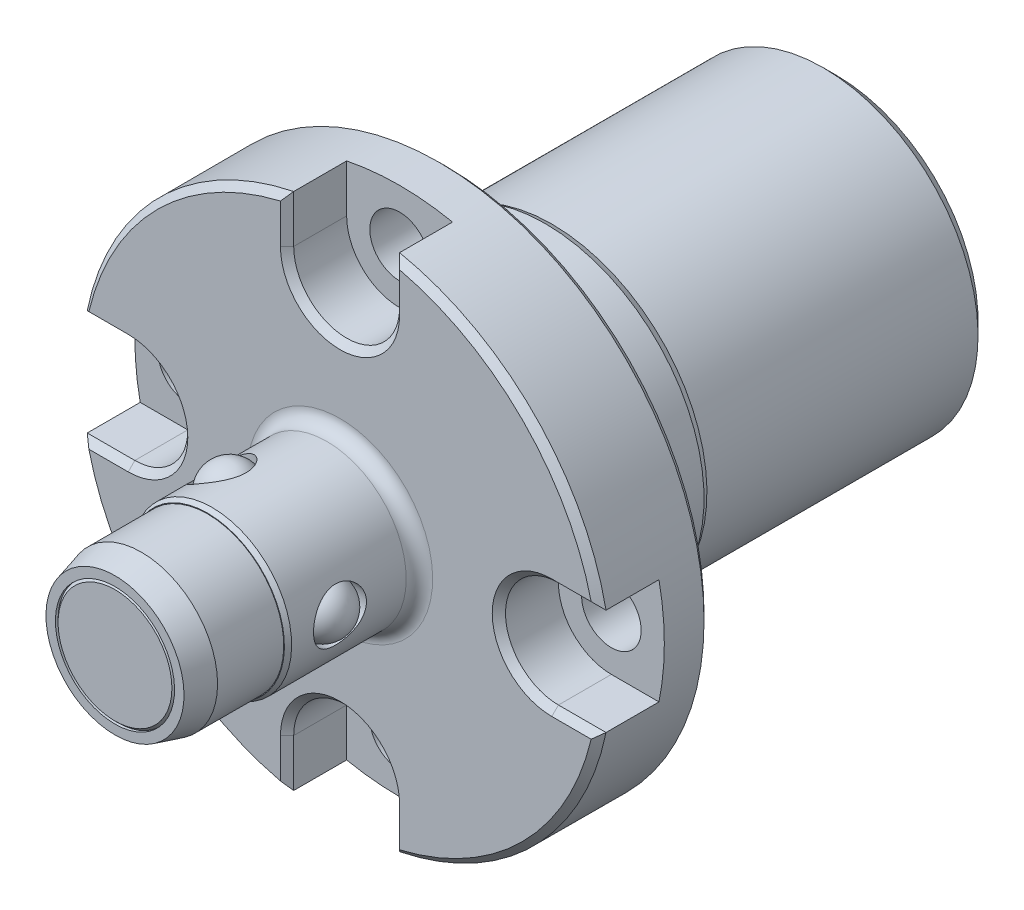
ISO-10303-21;
HEADER;
FILE_DESCRIPTION(('STEP AP214'),'2;1');
FILE_NAME('part.step','',(''),(''),'','','');
FILE_SCHEMA(('AUTOMOTIVE_DESIGN { 1 0 10303 214 1 1 1 1 }'));
ENDSEC;
DATA;
#1=APPLICATION_CONTEXT('core data for automotive mechanical design processes');
#2=APPLICATION_PROTOCOL_DEFINITION('international standard','automotive_design',2000,#1);
#3=PRODUCT_CONTEXT('',#1,'mechanical');
#4=PRODUCT('Part','Part','',(#3));
#5=PRODUCT_RELATED_PRODUCT_CATEGORY('part','',(#4));
#6=PRODUCT_DEFINITION_FORMATION('','',#4);
#7=PRODUCT_DEFINITION_CONTEXT('part definition',#1,'design');
#8=PRODUCT_DEFINITION('design','',#6,#7);
#9=PRODUCT_DEFINITION_SHAPE('','',#8);
#10=(LENGTH_UNIT() NAMED_UNIT(*) SI_UNIT(.MILLI.,.METRE.));
#11=(NAMED_UNIT(*) PLANE_ANGLE_UNIT() SI_UNIT($,.RADIAN.));
#12=(NAMED_UNIT(*) SI_UNIT($,.STERADIAN.) SOLID_ANGLE_UNIT());
#13=UNCERTAINTY_MEASURE_WITH_UNIT(LENGTH_MEASURE(1.E-05),#10,'distance_accuracy_value','');
#14=(GEOMETRIC_REPRESENTATION_CONTEXT(3) GLOBAL_UNCERTAINTY_ASSIGNED_CONTEXT((#13)) GLOBAL_UNIT_ASSIGNED_CONTEXT((#10,
#11,#12)) REPRESENTATION_CONTEXT('',''));
#15=CARTESIAN_POINT('',(0.,0.,0.));
#16=DIRECTION('',(0.,0.,1.));
#17=DIRECTION('',(1.,0.,0.));
#18=AXIS2_PLACEMENT_3D('',#15,#16,#17);
#19=CARTESIAN_POINT('',(-2.33475248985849,-4.0439099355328,14.));
#20=DIRECTION('',(0.,0.,1.));
#21=DIRECTION('',(-0.5,-0.866025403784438,0.));
#22=AXIS2_PLACEMENT_3D('',#19,#20,#21);
#23=SPHERICAL_SURFACE('',#22,2.);
#24=CARTESIAN_POINT('',(-2.33475248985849,-4.0439099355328,14.));
#25=DIRECTION('',(-0.5,-0.866025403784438,0.));
#26=DIRECTION('',(0.866025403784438,-0.5,0.));
#27=AXIS2_PLACEMENT_3D('',#24,#25,#26);
#28=SPHERICAL_SURFACE('',#27,2.);
#29=CARTESIAN_POINT('',(-2.5,-4.33012701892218,14.));
#30=DIRECTION('',(-0.5,-0.866025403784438,0.));
#31=DIRECTION('',(0.866025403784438,-0.5,0.));
#32=AXIS2_PLACEMENT_3D('',#29,#30,#31);
#33=CIRCLE('',#32,1.97250425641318);
#34=CARTESIAN_POINT('',(-0.791761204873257,-5.31637914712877,14.));
#35=VERTEX_POINT('',#34);
#36=EDGE_CURVE('E24',#35,#35,#33,.F.);
#37=ORIENTED_EDGE('',*,*,#36,.F.);
#38=EDGE_LOOP('',(#37));
#39=FACE_BOUND('',#38,.T.);
#40=ADVANCED_FACE('F14',(#39),#28,.T.);
#41=CARTESIAN_POINT('',(0.,0.,-21.4));
#42=DIRECTION('',(0.,0.,1.));
#43=DIRECTION('',(0.,-1.,0.));
#44=AXIS2_PLACEMENT_3D('',#41,#42,#43);
#45=PLANE('',#44);
#46=CARTESIAN_POINT('',(0.,0.,-21.4));
#47=DIRECTION('',(0.,0.,1.));
#48=DIRECTION('',(0.,-1.,0.));
#49=AXIS2_PLACEMENT_3D('',#46,#47,#48);
#50=CIRCLE('',#49,2.75);
#51=CARTESIAN_POINT('',(0.,-2.75,-21.4));
#52=VERTEX_POINT('',#51);
#53=EDGE_CURVE('E91',#52,#52,#50,.F.);
#54=ORIENTED_EDGE('',*,*,#53,.T.);
#55=EDGE_LOOP('',(#54));
#56=FACE_BOUND('',#55,.T.);
#57=ADVANCED_FACE('F331',(#56),#45,.F.);
#58=CARTESIAN_POINT('',(0.,0.,-21.4));
#59=DIRECTION('',(0.,0.,1.));
#60=DIRECTION('',(1.,0.,0.));
#61=AXIS2_PLACEMENT_3D('',#58,#59,#60);
#62=CONICAL_SURFACE('',#61,2.75,0.785398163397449);
#63=CARTESIAN_POINT('',(0.,0.,-21.65));
#64=DIRECTION('',(0.,0.,1.));
#65=DIRECTION('',(1.,0.,0.));
#66=AXIS2_PLACEMENT_3D('',#63,#64,#65);
#67=CIRCLE('',#66,2.5);
#68=CARTESIAN_POINT('',(2.5,0.,-21.65));
#69=VERTEX_POINT('',#68);
#70=EDGE_CURVE('E138',#69,#69,#67,.F.);
#71=ORIENTED_EDGE('',*,*,#70,.T.);
#72=EDGE_LOOP('',(#71));
#73=FACE_BOUND('',#72,.T.);
#74=ORIENTED_EDGE('',*,*,#53,.F.);
#75=EDGE_LOOP('',(#74));
#76=FACE_BOUND('',#75,.T.);
#77=ADVANCED_FACE('F327',(#73,#76),#62,.F.);
#78=CARTESIAN_POINT('',(0.,0.,-31.4));
#79=DIRECTION('',(0.,0.,1.));
#80=DIRECTION('',(1.,0.,0.));
#81=AXIS2_PLACEMENT_3D('',#78,#79,#80);
#82=CYLINDRICAL_SURFACE('',#81,2.5);
#83=ORIENTED_EDGE('',*,*,#70,.F.);
#84=EDGE_LOOP('',(#83));
#85=FACE_BOUND('',#84,.T.);
#86=CARTESIAN_POINT('',(0.,0.,-26.65));
#87=DIRECTION('',(0.,0.,-1.));
#88=DIRECTION('',(-1.,0.,0.));
#89=AXIS2_PLACEMENT_3D('',#86,#87,#88);
#90=CIRCLE('',#89,2.5);
#91=CARTESIAN_POINT('',(-2.5,0.,-26.65));
#92=VERTEX_POINT('',#91);
#93=EDGE_CURVE('E141',#92,#92,#90,.F.);
#94=ORIENTED_EDGE('',*,*,#93,.F.);
#95=EDGE_LOOP('',(#94));
#96=FACE_BOUND('',#95,.T.);
#97=ADVANCED_FACE('F323',(#85,#96),#82,.F.);
#98=CARTESIAN_POINT('',(0.,0.,-26.25));
#99=DIRECTION('',(0.,0.,-1.));
#100=DIRECTION('',(-1.,0.,0.));
#101=AXIS2_PLACEMENT_3D('',#98,#99,#100);
#102=CONICAL_SURFACE('',#101,2.1,0.785398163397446);
#103=ORIENTED_EDGE('',*,*,#93,.T.);
#104=EDGE_LOOP('',(#103));
#105=FACE_BOUND('',#104,.T.);
#106=CARTESIAN_POINT('',(0.,0.,-26.9));
#107=DIRECTION('',(0.,0.,1.));
#108=DIRECTION('',(1.,0.,0.));
#109=AXIS2_PLACEMENT_3D('',#106,#107,#108);
#110=CIRCLE('',#109,2.75);
#111=CARTESIAN_POINT('',(2.75,0.,-26.9));
#112=VERTEX_POINT('',#111);
#113=EDGE_CURVE('E142',#112,#112,#110,.T.);
#114=ORIENTED_EDGE('',*,*,#113,.F.);
#115=EDGE_LOOP('',(#114));
#116=FACE_BOUND('',#115,.T.);
#117=ADVANCED_FACE('F326',(#105,#116),#102,.F.);
#118=CARTESIAN_POINT('',(0.,0.,-26.9));
#119=DIRECTION('',(0.,0.,-1.));
#120=DIRECTION('',(-1.,0.,0.));
#121=AXIS2_PLACEMENT_3D('',#118,#119,#120);
#122=PLANE('',#121);
#123=ORIENTED_EDGE('',*,*,#113,.T.);
#124=EDGE_LOOP('',(#123));
#125=FACE_BOUND('',#124,.T.);
#126=CARTESIAN_POINT('',(0.,0.,-26.9));
#127=DIRECTION('',(0.,0.,-1.));
#128=DIRECTION('',(-1.,0.,0.));
#129=AXIS2_PLACEMENT_3D('',#126,#127,#128);
#130=CIRCLE('',#129,10.5);
#131=CARTESIAN_POINT('',(-10.5,0.,-26.9));
#132=VERTEX_POINT('',#131);
#133=EDGE_CURVE('E148',#132,#132,#130,.F.);
#134=ORIENTED_EDGE('',*,*,#133,.F.);
#135=EDGE_LOOP('',(#134));
#136=FACE_BOUND('',#135,.T.);
#137=ADVANCED_FACE('F335',(#125,#136),#122,.T.);
#138=CARTESIAN_POINT('',(0.,0.,-27.));
#139=DIRECTION('',(0.,0.,1.));
#140=DIRECTION('',(0.,-1.,0.));
#141=AXIS2_PLACEMENT_3D('',#138,#139,#140);
#142=PLANE('',#141);
#143=CARTESIAN_POINT('',(-7.24206462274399,4.45,-27.));
#144=DIRECTION('',(0.,0.,1.));
#145=DIRECTION('',(0.,-1.,0.));
#146=AXIS2_PLACEMENT_3D('',#143,#144,#145);
#147=CIRCLE('',#146,1.);
#148=CARTESIAN_POINT('',(-7.24206462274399,3.45,-27.));
#149=VERTEX_POINT('',#148);
#150=EDGE_CURVE('E120',#149,#149,#147,.F.);
#151=ORIENTED_EDGE('',*,*,#150,.T.);
#152=EDGE_LOOP('',(#151));
#153=FACE_BOUND('',#152,.T.);
#154=CARTESIAN_POINT('',(-7.24206462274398,-4.45,-27.));
#155=DIRECTION('',(0.,0.,1.));
#156=DIRECTION('',(0.,-1.,0.));
#157=AXIS2_PLACEMENT_3D('',#154,#155,#156);
#158=CIRCLE('',#157,1.);
#159=CARTESIAN_POINT('',(-7.24206462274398,-5.45,-27.));
#160=VERTEX_POINT('',#159);
#161=EDGE_CURVE('E78',#160,#160,#158,.F.);
#162=ORIENTED_EDGE('',*,*,#161,.T.);
#163=EDGE_LOOP('',(#162));
#164=FACE_BOUND('',#163,.T.);
#165=CARTESIAN_POINT('',(-3.53470488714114,-5.95182681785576,-27.));
#166=DIRECTION('',(0.,0.,1.));
#167=DIRECTION('',(0.,-1.,0.));
#168=AXIS2_PLACEMENT_3D('',#165,#166,#167);
#169=CIRCLE('',#168,2.);
#170=CARTESIAN_POINT('',(-4.41310636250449,-7.74860472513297,-27.));
#171=VERTEX_POINT('',#170);
#172=CARTESIAN_POINT('',(-5.38838476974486,-5.20091344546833,-27.));
#173=VERTEX_POINT('',#172);
#174=EDGE_CURVE('E130',#171,#173,#169,.F.);
#175=ORIENTED_EDGE('',*,*,#174,.T.);
#176=CARTESIAN_POINT('',(-7.24206462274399,-4.45,-27.));
#177=DIRECTION('',(0.,0.,1.));
#178=DIRECTION('',(0.,-1.,0.));
#179=AXIS2_PLACEMENT_3D('',#176,#177,#178);
#180=CIRCLE('',#179,2.);
#181=CARTESIAN_POINT('',(-8.94607982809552,-5.49705882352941,-27.));
#182=VERTEX_POINT('',#181);
#183=EDGE_CURVE('E79',#182,#173,#180,.F.);
#184=ORIENTED_EDGE('',*,*,#183,.F.);
#185=CARTESIAN_POINT('',(0.,0.,-27.));
#186=DIRECTION('',(0.,0.,1.));
#187=DIRECTION('',(0.,-1.,0.));
#188=AXIS2_PLACEMENT_3D('',#185,#186,#187);
#189=CIRCLE('',#188,10.5);
#190=CARTESIAN_POINT('',(-8.94607982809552,5.49705882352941,-27.));
#191=VERTEX_POINT('',#190);
#192=EDGE_CURVE('E74',#191,#182,#189,.F.);
#193=ORIENTED_EDGE('',*,*,#192,.F.);
#194=CARTESIAN_POINT('',(-7.24206462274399,4.45,-27.));
#195=DIRECTION('',(0.,0.,1.));
#196=DIRECTION('',(0.,-1.,0.));
#197=AXIS2_PLACEMENT_3D('',#194,#195,#196);
#198=CIRCLE('',#197,2.);
#199=CARTESIAN_POINT('',(-5.38838476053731,5.20091342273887,-27.));
#200=VERTEX_POINT('',#199);
#201=EDGE_CURVE('E67',#200,#191,#198,.F.);
#202=ORIENTED_EDGE('',*,*,#201,.F.);
#203=CARTESIAN_POINT('',(-3.53470488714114,5.95182681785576,-27.));
#204=DIRECTION('',(0.,0.,1.));
#205=DIRECTION('',(0.,-1.,0.));
#206=AXIS2_PLACEMENT_3D('',#203,#204,#205);
#207=CIRCLE('',#206,2.);
#208=CARTESIAN_POINT('',(-4.4131063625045,7.74860472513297,-27.));
#209=VERTEX_POINT('',#208);
#210=EDGE_CURVE('E18',#200,#209,#207,.F.);
#211=ORIENTED_EDGE('',*,*,#210,.T.);
#212=CARTESIAN_POINT('',(-0.625,0.,-27.));
#213=DIRECTION('',(0.,0.,1.));
#214=DIRECTION('',(0.,-1.,0.));
#215=AXIS2_PLACEMENT_3D('',#212,#213,#214);
#216=CIRCLE('',#215,8.625);
#217=EDGE_CURVE('E61',#209,#171,#216,.F.);
#218=ORIENTED_EDGE('',*,*,#217,.T.);
#219=EDGE_LOOP('',(#175,#184,#193,#202,#211,#218));
#220=FACE_BOUND('',#219,.T.);
#221=ADVANCED_FACE('F16',(#153,#164,#220),#142,.T.);
#222=CARTESIAN_POINT('',(-3.53470488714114,5.95182681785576,-27.));
#223=DIRECTION('',(0.,0.,1.));
#224=DIRECTION('',(0.,-1.,0.));
#225=AXIS2_PLACEMENT_3D('',#222,#223,#224);
#226=CYLINDRICAL_SURFACE('',#225,2.);
#227=DIRECTION('',(0.,0.,1.));
#228=VECTOR('',#227,1.);
#229=CARTESIAN_POINT('',(-4.4131063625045,7.74860472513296,-27.));
#230=LINE('',#229,#228);
#231=CARTESIAN_POINT('',(-4.4131063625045,7.74860472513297,-28.));
#232=VERTEX_POINT('',#231);
#233=EDGE_CURVE('E87',#232,#209,#230,.T.);
#234=ORIENTED_EDGE('',*,*,#233,.T.);
#235=ORIENTED_EDGE('',*,*,#210,.F.);
#236=DIRECTION('',(0.,0.,1.));
#237=VECTOR('',#236,1.);
#238=CARTESIAN_POINT('',(-5.38838476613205,5.20091343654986,-27.));
#239=LINE('',#238,#237);
#240=CARTESIAN_POINT('',(-5.38838476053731,5.20091342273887,-28.));
#241=VERTEX_POINT('',#240);
#242=EDGE_CURVE('E85',#241,#200,#239,.T.);
#243=ORIENTED_EDGE('',*,*,#242,.F.);
#244=CARTESIAN_POINT('',(-3.53470488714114,5.95182681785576,-28.));
#245=DIRECTION('',(0.,0.,1.));
#246=DIRECTION('',(0.,-1.,0.));
#247=AXIS2_PLACEMENT_3D('',#244,#245,#246);
#248=CIRCLE('',#247,2.);
#249=EDGE_CURVE('E115',#241,#232,#248,.F.);
#250=ORIENTED_EDGE('',*,*,#249,.T.);
#251=EDGE_LOOP('',(#234,#235,#243,#250));
#252=FACE_BOUND('',#251,.T.);
#253=ADVANCED_FACE('F83',(#252),#226,.F.);
#254=CARTESIAN_POINT('',(-0.625,0.,-27.));
#255=DIRECTION('',(0.,0.,1.));
#256=DIRECTION('',(0.,-1.,0.));
#257=AXIS2_PLACEMENT_3D('',#254,#255,#256);
#258=CYLINDRICAL_SURFACE('',#257,8.625);
#259=CARTESIAN_POINT('',(-0.625,0.,-28.));
#260=DIRECTION('',(0.,0.,1.));
#261=DIRECTION('',(0.,-1.,0.));
#262=AXIS2_PLACEMENT_3D('',#259,#260,#261);
#263=CIRCLE('',#262,8.625);
#264=CARTESIAN_POINT('',(-4.4131063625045,-7.74860472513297,-28.));
#265=VERTEX_POINT('',#264);
#266=EDGE_CURVE('E113',#232,#265,#263,.F.);
#267=ORIENTED_EDGE('',*,*,#266,.T.);
#268=DIRECTION('',(0.,0.,1.));
#269=VECTOR('',#268,1.);
#270=CARTESIAN_POINT('',(-4.41310636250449,-7.74860472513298,-27.));
#271=LINE('',#270,#269);
#272=EDGE_CURVE('E131',#265,#171,#271,.T.);
#273=ORIENTED_EDGE('',*,*,#272,.T.);
#274=ORIENTED_EDGE('',*,*,#217,.F.);
#275=ORIENTED_EDGE('',*,*,#233,.F.);
#276=EDGE_LOOP('',(#267,#273,#274,#275));
#277=FACE_BOUND('',#276,.T.);
#278=ADVANCED_FACE('F371',(#277),#258,.F.);
#279=CARTESIAN_POINT('',(-3.53470488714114,-5.95182681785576,-27.));
#280=DIRECTION('',(0.,0.,1.));
#281=DIRECTION('',(0.,-1.,0.));
#282=AXIS2_PLACEMENT_3D('',#279,#280,#281);
#283=CYLINDRICAL_SURFACE('',#282,2.);
#284=DIRECTION('',(0.,0.,1.));
#285=VECTOR('',#284,1.);
#286=CARTESIAN_POINT('',(-5.38838478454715,-5.20091348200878,-27.));
#287=LINE('',#286,#285);
#288=CARTESIAN_POINT('',(-5.38838476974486,-5.20091344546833,-28.));
#289=VERTEX_POINT('',#288);
#290=EDGE_CURVE('E129',#173,#289,#287,.F.);
#291=ORIENTED_EDGE('',*,*,#290,.F.);
#292=ORIENTED_EDGE('',*,*,#174,.F.);
#293=ORIENTED_EDGE('',*,*,#272,.F.);
#294=CARTESIAN_POINT('',(-3.53470488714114,-5.95182681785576,-28.));
#295=DIRECTION('',(0.,0.,1.));
#296=DIRECTION('',(0.,-1.,0.));
#297=AXIS2_PLACEMENT_3D('',#294,#295,#296);
#298=CIRCLE('',#297,2.);
#299=EDGE_CURVE('E109',#265,#289,#298,.F.);
#300=ORIENTED_EDGE('',*,*,#299,.T.);
#301=EDGE_LOOP('',(#291,#292,#293,#300));
#302=FACE_BOUND('',#301,.T.);
#303=ADVANCED_FACE('F358',(#302),#283,.F.);
#304=CARTESIAN_POINT('',(-7.24206462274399,4.45,-27.));
#305=DIRECTION('',(0.,0.,1.));
#306=DIRECTION('',(0.,-1.,0.));
#307=AXIS2_PLACEMENT_3D('',#304,#305,#306);
#308=CYLINDRICAL_SURFACE('',#307,1.);
#309=CARTESIAN_POINT('',(-7.24206462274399,4.45,-28.));
#310=DIRECTION('',(0.,0.,1.));
#311=DIRECTION('',(0.,-1.,0.));
#312=AXIS2_PLACEMENT_3D('',#309,#310,#311);
#313=CIRCLE('',#312,1.);
#314=CARTESIAN_POINT('',(-7.24206462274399,3.45,-28.));
#315=VERTEX_POINT('',#314);
#316=EDGE_CURVE('E99',#315,#315,#313,.F.);
#317=ORIENTED_EDGE('',*,*,#316,.T.);
#318=EDGE_LOOP('',(#317));
#319=FACE_BOUND('',#318,.T.);
#320=ORIENTED_EDGE('',*,*,#150,.F.);
#321=EDGE_LOOP('',(#320));
#322=FACE_BOUND('',#321,.T.);
#323=ADVANCED_FACE('F354',(#319,#322),#308,.F.);
#324=CARTESIAN_POINT('',(-7.24206462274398,-4.45,-27.));
#325=DIRECTION('',(0.,0.,1.));
#326=DIRECTION('',(0.,-1.,0.));
#327=AXIS2_PLACEMENT_3D('',#324,#325,#326);
#328=CYLINDRICAL_SURFACE('',#327,1.);
#329=CARTESIAN_POINT('',(-7.24206462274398,-4.45,-28.));
#330=DIRECTION('',(0.,0.,1.));
#331=DIRECTION('',(0.,-1.,0.));
#332=AXIS2_PLACEMENT_3D('',#329,#330,#331);
#333=CIRCLE('',#332,1.);
#334=CARTESIAN_POINT('',(-7.24206462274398,-5.45,-28.));
#335=VERTEX_POINT('',#334);
#336=EDGE_CURVE('E103',#335,#335,#333,.F.);
#337=ORIENTED_EDGE('',*,*,#336,.T.);
#338=EDGE_LOOP('',(#337));
#339=FACE_BOUND('',#338,.T.);
#340=ORIENTED_EDGE('',*,*,#161,.F.);
#341=EDGE_LOOP('',(#340));
#342=FACE_BOUND('',#341,.T.);
#343=ADVANCED_FACE('F357',(#339,#342),#328,.F.);
#344=CARTESIAN_POINT('',(-7.24206462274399,-4.45,-27.));
#345=DIRECTION('',(0.,0.,1.));
#346=DIRECTION('',(0.,-1.,0.));
#347=AXIS2_PLACEMENT_3D('',#344,#345,#346);
#348=CYLINDRICAL_SURFACE('',#347,2.);
#349=DIRECTION('',(0.,0.,1.));
#350=VECTOR('',#349,1.);
#351=CARTESIAN_POINT('',(-8.94607982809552,-5.49705882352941,-27.5));
#352=LINE('',#351,#350);
#353=CARTESIAN_POINT('',(-8.94607982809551,-5.49705882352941,-28.));
#354=VERTEX_POINT('',#353);
#355=EDGE_CURVE('E126',#354,#182,#352,.T.);
#356=ORIENTED_EDGE('',*,*,#355,.T.);
#357=ORIENTED_EDGE('',*,*,#183,.T.);
#358=ORIENTED_EDGE('',*,*,#290,.T.);
#359=CARTESIAN_POINT('',(-7.24206462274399,-4.45,-28.));
#360=DIRECTION('',(0.,0.,1.));
#361=DIRECTION('',(0.,-1.,0.));
#362=AXIS2_PLACEMENT_3D('',#359,#360,#361);
#363=CIRCLE('',#362,2.);
#364=CARTESIAN_POINT('',(-9.18162512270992,-3.96203989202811,-28.));
#365=VERTEX_POINT('',#364);
#366=EDGE_CURVE('E106',#289,#365,#363,.T.);
#367=ORIENTED_EDGE('',*,*,#366,.T.);
#368=EDGE_CURVE('E110',#365,#354,#363,.T.);
#369=ORIENTED_EDGE('',*,*,#368,.T.);
#370=EDGE_LOOP('',(#356,#357,#358,#367,#369));
#371=FACE_BOUND('',#370,.T.);
#372=ADVANCED_FACE('F362',(#371),#348,.T.);
#373=CARTESIAN_POINT('',(0.,0.,-29.5));
#374=DIRECTION('',(0.,0.,-1.));
#375=DIRECTION('',(0.,1.,0.));
#376=AXIS2_PLACEMENT_3D('',#373,#374,#375);
#377=CYLINDRICAL_SURFACE('',#376,10.5);
#378=ORIENTED_EDGE('',*,*,#133,.T.);
#379=EDGE_LOOP('',(#378));
#380=FACE_BOUND('',#379,.T.);
#381=ORIENTED_EDGE('',*,*,#355,.F.);
#382=CARTESIAN_POINT('',(0.,0.,-28.));
#383=DIRECTION('',(0.,0.,-1.));
#384=DIRECTION('',(0.,1.,0.));
#385=AXIS2_PLACEMENT_3D('',#382,#383,#384);
#386=CIRCLE('',#385,10.5);
#387=CARTESIAN_POINT('',(-8.94607982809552,5.49705882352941,-28.));
#388=VERTEX_POINT('',#387);
#389=EDGE_CURVE('E254',#354,#388,#386,.T.);
#390=ORIENTED_EDGE('',*,*,#389,.T.);
#391=DIRECTION('',(0.,0.,1.));
#392=VECTOR('',#391,1.);
#393=CARTESIAN_POINT('',(-8.94607982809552,5.49705882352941,-27.5));
#394=LINE('',#393,#392);
#395=EDGE_CURVE('E127',#388,#191,#394,.T.);
#396=ORIENTED_EDGE('',*,*,#395,.T.);
#397=ORIENTED_EDGE('',*,*,#192,.T.);
#398=EDGE_LOOP('',(#381,#390,#396,#397));
#399=FACE_BOUND('',#398,.T.);
#400=ADVANCED_FACE('F246',(#380,#399),#377,.F.);
#401=CARTESIAN_POINT('',(-7.24206462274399,4.45,-27.));
#402=DIRECTION('',(0.,0.,1.));
#403=DIRECTION('',(0.,-1.,0.));
#404=AXIS2_PLACEMENT_3D('',#401,#402,#403);
#405=CYLINDRICAL_SURFACE('',#404,2.);
#406=ORIENTED_EDGE('',*,*,#395,.F.);
#407=CARTESIAN_POINT('',(-7.24206462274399,4.45,-28.));
#408=DIRECTION('',(0.,0.,1.));
#409=DIRECTION('',(0.,-1.,0.));
#410=AXIS2_PLACEMENT_3D('',#407,#408,#409);
#411=CIRCLE('',#410,2.);
#412=CARTESIAN_POINT('',(-9.18162512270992,3.96203989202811,-28.));
#413=VERTEX_POINT('',#412);
#414=EDGE_CURVE('E117',#388,#413,#411,.T.);
#415=ORIENTED_EDGE('',*,*,#414,.T.);
#416=EDGE_CURVE('E90',#413,#241,#411,.T.);
#417=ORIENTED_EDGE('',*,*,#416,.T.);
#418=ORIENTED_EDGE('',*,*,#242,.T.);
#419=ORIENTED_EDGE('',*,*,#201,.T.);
#420=EDGE_LOOP('',(#406,#415,#417,#418,#419));
#421=FACE_BOUND('',#420,.T.);
#422=ADVANCED_FACE('F88',(#421),#405,.T.);
#423=CARTESIAN_POINT('',(0.,0.,-28.));
#424=DIRECTION('',(0.,0.,1.));
#425=DIRECTION('',(0.,-1.,0.));
#426=AXIS2_PLACEMENT_3D('',#423,#424,#425);
#427=PLANE('',#426);
#428=ORIENTED_EDGE('',*,*,#336,.F.);
#429=EDGE_LOOP('',(#428));
#430=FACE_BOUND('',#429,.T.);
#431=ORIENTED_EDGE('',*,*,#316,.F.);
#432=EDGE_LOOP('',(#431));
#433=FACE_BOUND('',#432,.T.);
#434=ORIENTED_EDGE('',*,*,#416,.F.);
#435=CARTESIAN_POINT('',(0.,0.,-28.));
#436=DIRECTION('',(0.,0.,-1.));
#437=DIRECTION('',(0.,1.,0.));
#438=AXIS2_PLACEMENT_3D('',#435,#436,#437);
#439=CIRCLE('',#438,10.);
#440=EDGE_CURVE('E32',#413,#365,#439,.T.);
#441=ORIENTED_EDGE('',*,*,#440,.T.);
#442=ORIENTED_EDGE('',*,*,#366,.F.);
#443=ORIENTED_EDGE('',*,*,#299,.F.);
#444=ORIENTED_EDGE('',*,*,#266,.F.);
#445=ORIENTED_EDGE('',*,*,#249,.F.);
#446=EDGE_LOOP('',(#434,#441,#442,#443,#444,#445));
#447=FACE_BOUND('',#446,.T.);
#448=ADVANCED_FACE('F349',(#430,#433,#447),#427,.F.);
#449=CARTESIAN_POINT('',(10.5,0.,-28.));
#450=DIRECTION('',(0.,0.,-1.));
#451=DIRECTION('',(0.,1.,0.));
#452=AXIS2_PLACEMENT_3D('',#449,#450,#451);
#453=PLANE('',#452);
#454=ORIENTED_EDGE('',*,*,#414,.F.);
#455=ORIENTED_EDGE('',*,*,#389,.F.);
#456=ORIENTED_EDGE('',*,*,#368,.F.);
#457=EDGE_CURVE('E431',#365,#413,#439,.T.);
#458=ORIENTED_EDGE('',*,*,#457,.T.);
#459=EDGE_LOOP('',(#454,#455,#456,#458));
#460=FACE_BOUND('',#459,.T.);
#461=ADVANCED_FACE('F352',(#460),#453,.F.);
#462=CARTESIAN_POINT('',(0.,0.,-29.5));
#463=DIRECTION('',(0.,0.,-1.));
#464=DIRECTION('',(0.,1.,0.));
#465=AXIS2_PLACEMENT_3D('',#462,#463,#464);
#466=CYLINDRICAL_SURFACE('',#465,10.);
#467=ORIENTED_EDGE('',*,*,#457,.F.);
#468=ORIENTED_EDGE('',*,*,#440,.F.);
#469=EDGE_LOOP('',(#467,#468));
#470=FACE_BOUND('',#469,.T.);
#471=CARTESIAN_POINT('',(0.,0.,-29.5));
#472=DIRECTION('',(0.,0.,-1.));
#473=DIRECTION('',(0.,1.,0.));
#474=AXIS2_PLACEMENT_3D('',#471,#472,#473);
#475=CIRCLE('',#474,10.);
#476=CARTESIAN_POINT('',(0.,10.,-29.5));
#477=VERTEX_POINT('',#476);
#478=EDGE_CURVE('E262',#477,#477,#475,.T.);
#479=ORIENTED_EDGE('',*,*,#478,.T.);
#480=EDGE_LOOP('',(#479));
#481=FACE_BOUND('',#480,.T.);
#482=ADVANCED_FACE('F896',(#470,#481),#466,.F.);
#483=CARTESIAN_POINT('',(3.15,0.,-29.5));
#484=DIRECTION('',(0.,0.,-1.));
#485=DIRECTION('',(0.,1.,0.));
#486=AXIS2_PLACEMENT_3D('',#483,#484,#485);
#487=PLANE('',#486);
#488=CARTESIAN_POINT('',(0.,0.,-29.5));
#489=DIRECTION('',(0.,0.,-1.));
#490=DIRECTION('',(0.,1.,0.));
#491=AXIS2_PLACEMENT_3D('',#488,#489,#490);
#492=CIRCLE('',#491,10.7);
#493=CARTESIAN_POINT('',(0.,10.7,-29.5));
#494=VERTEX_POINT('',#493);
#495=EDGE_CURVE('E203',#494,#494,#492,.T.);
#496=ORIENTED_EDGE('',*,*,#495,.T.);
#497=EDGE_LOOP('',(#496));
#498=FACE_BOUND('',#497,.T.);
#499=ORIENTED_EDGE('',*,*,#478,.F.);
#500=EDGE_LOOP('',(#499));
#501=FACE_BOUND('',#500,.T.);
#502=ADVANCED_FACE('F291',(#498,#501),#487,.T.);
#503=CARTESIAN_POINT('',(0.,0.,-29.5));
#504=DIRECTION('',(0.,0.,1.));
#505=DIRECTION('',(0.,-1.,0.));
#506=AXIS2_PLACEMENT_3D('',#503,#504,#505);
#507=CONICAL_SURFACE('',#506,10.7,0.785398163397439);
#508=CARTESIAN_POINT('',(0.,0.,-28.5));
#509=DIRECTION('',(0.,0.,-1.));
#510=DIRECTION('',(0.,1.,0.));
#511=AXIS2_PLACEMENT_3D('',#508,#509,#510);
#512=CIRCLE('',#511,11.7);
#513=CARTESIAN_POINT('',(0.,11.7,-28.5));
#514=VERTEX_POINT('',#513);
#515=EDGE_CURVE('E200',#514,#514,#512,.F.);
#516=ORIENTED_EDGE('',*,*,#515,.F.);
#517=EDGE_LOOP('',(#516));
#518=FACE_BOUND('',#517,.T.);
#519=ORIENTED_EDGE('',*,*,#495,.F.);
#520=EDGE_LOOP('',(#519));
#521=FACE_BOUND('',#520,.T.);
#522=ADVANCED_FACE('F287',(#518,#521),#507,.T.);
#523=CARTESIAN_POINT('',(0.,0.,-29.5));
#524=DIRECTION('',(0.,0.,-1.));
#525=DIRECTION('',(0.,1.,0.));
#526=AXIS2_PLACEMENT_3D('',#523,#524,#525);
#527=CYLINDRICAL_SURFACE('',#526,11.7);
#528=ORIENTED_EDGE('',*,*,#515,.T.);
#529=EDGE_LOOP('',(#528));
#530=FACE_BOUND('',#529,.T.);
#531=CARTESIAN_POINT('',(0.,0.,-8.01961524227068));
#532=DIRECTION('',(0.,0.,-1.));
#533=DIRECTION('',(0.,1.,0.));
#534=AXIS2_PLACEMENT_3D('',#531,#532,#533);
#535=CIRCLE('',#534,11.7);
#536=CARTESIAN_POINT('',(0.,11.7,-8.01961524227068));
#537=VERTEX_POINT('',#536);
#538=EDGE_CURVE('E419',#537,#537,#535,.T.);
#539=ORIENTED_EDGE('',*,*,#538,.T.);
#540=EDGE_LOOP('',(#539));
#541=FACE_BOUND('',#540,.T.);
#542=ADVANCED_FACE('F290',(#530,#541),#527,.T.);
#543=CARTESIAN_POINT('',(0.,0.,-8.01961524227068));
#544=DIRECTION('',(0.,0.,1.));
#545=DIRECTION('',(0.,-1.,0.));
#546=AXIS2_PLACEMENT_3D('',#543,#544,#545);
#547=CONICAL_SURFACE('',#546,11.7,0.523598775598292);
#548=CARTESIAN_POINT('',(0.,0.,-7.5));
#549=DIRECTION('',(0.,0.,-1.));
#550=DIRECTION('',(0.,1.,0.));
#551=AXIS2_PLACEMENT_3D('',#548,#549,#550);
#552=CIRCLE('',#551,12.);
#553=CARTESIAN_POINT('',(0.,12.,-7.5));
#554=VERTEX_POINT('',#553);
#555=EDGE_CURVE('E421',#554,#554,#552,.T.);
#556=ORIENTED_EDGE('',*,*,#555,.T.);
#557=EDGE_LOOP('',(#556));
#558=FACE_BOUND('',#557,.T.);
#559=ORIENTED_EDGE('',*,*,#538,.F.);
#560=EDGE_LOOP('',(#559));
#561=FACE_BOUND('',#560,.T.);
#562=ADVANCED_FACE('F343',(#558,#561),#547,.T.);
#563=CARTESIAN_POINT('',(0.,0.,25.));
#564=DIRECTION('',(0.,0.,1.));
#565=DIRECTION('',(1.,0.,0.));
#566=AXIS2_PLACEMENT_3D('',#563,#564,#565);
#567=PLANE('',#566);
#568=CARTESIAN_POINT('',(0.,0.,25.));
#569=DIRECTION('',(0.,0.,1.));
#570=DIRECTION('',(1.,0.,0.));
#571=AXIS2_PLACEMENT_3D('',#568,#569,#570);
#572=CIRCLE('',#571,4.3);
#573=CARTESIAN_POINT('',(4.3,0.,25.));
#574=VERTEX_POINT('',#573);
#575=EDGE_CURVE('E102',#574,#574,#572,.T.);
#576=ORIENTED_EDGE('',*,*,#575,.T.);
#577=EDGE_LOOP('',(#576));
#578=FACE_BOUND('',#577,.T.);
#579=ADVANCED_FACE('F340',(#578),#567,.T.);
#580=CARTESIAN_POINT('',(0.,0.,-29.5));
#581=DIRECTION('',(0.,0.,-1.));
#582=DIRECTION('',(0.,1.,0.));
#583=AXIS2_PLACEMENT_3D('',#580,#581,#582);
#584=CYLINDRICAL_SURFACE('',#583,12.);
#585=CARTESIAN_POINT('',(0.,0.,0.));
#586=DIRECTION('',(0.,0.,-1.));
#587=DIRECTION('',(0.,1.,0.));
#588=AXIS2_PLACEMENT_3D('',#585,#586,#587);
#589=CIRCLE('',#588,12.);
#590=CARTESIAN_POINT('',(0.,12.,0.));
#591=VERTEX_POINT('',#590);
#592=EDGE_CURVE('E523',#591,#591,#589,.F.);
#593=ORIENTED_EDGE('',*,*,#592,.F.);
#594=EDGE_LOOP('',(#593));
#595=FACE_BOUND('',#594,.T.);
#596=ORIENTED_EDGE('',*,*,#555,.F.);
#597=EDGE_LOOP('',(#596));
#598=FACE_BOUND('',#597,.T.);
#599=ADVANCED_FACE('F301',(#595,#598),#584,.T.);
#600=CARTESIAN_POINT('',(1.1172740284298E-13,16.,0.3));
#601=DIRECTION('',(0.,0.,-1.));
#602=DIRECTION('',(0.,1.,0.));
#603=AXIS2_PLACEMENT_3D('',#600,#601,#602);
#604=CONICAL_SURFACE('',#603,2.25,0.78539816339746);
#605=CARTESIAN_POINT('',(1.1172740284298E-13,16.,0.));
#606=DIRECTION('',(0.,0.,-1.));
#607=DIRECTION('',(0.,1.,0.));
#608=AXIS2_PLACEMENT_3D('',#605,#606,#607);
#609=CIRCLE('',#608,2.55);
#610=CARTESIAN_POINT('',(1.1172740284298E-13,18.55,0.));
#611=VERTEX_POINT('',#610);
#612=EDGE_CURVE('E179',#611,#611,#609,.F.);
#613=ORIENTED_EDGE('',*,*,#612,.F.);
#614=EDGE_LOOP('',(#613));
#615=FACE_BOUND('',#614,.T.);
#616=CARTESIAN_POINT('',(1.1172740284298E-13,16.,0.3));
#617=DIRECTION('',(0.,0.,-1.));
#618=DIRECTION('',(0.,1.,0.));
#619=AXIS2_PLACEMENT_3D('',#616,#617,#618);
#620=CIRCLE('',#619,2.25);
#621=CARTESIAN_POINT('',(1.1172740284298E-13,18.25,0.3));
#622=VERTEX_POINT('',#621);
#623=EDGE_CURVE('E191',#622,#622,#620,.T.);
#624=ORIENTED_EDGE('',*,*,#623,.F.);
#625=EDGE_LOOP('',(#624));
#626=FACE_BOUND('',#625,.T.);
#627=ADVANCED_FACE('F297',(#615,#626),#604,.F.);
#628=CARTESIAN_POINT('',(-16.,0.,0.3));
#629=DIRECTION('',(0.,0.,-1.));
#630=DIRECTION('',(0.,1.,0.));
#631=AXIS2_PLACEMENT_3D('',#628,#629,#630);
#632=CONICAL_SURFACE('',#631,2.25,0.78539816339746);
#633=CARTESIAN_POINT('',(-16.,0.,0.));
#634=DIRECTION('',(0.,0.,-1.));
#635=DIRECTION('',(0.,1.,0.));
#636=AXIS2_PLACEMENT_3D('',#633,#634,#635);
#637=CIRCLE('',#636,2.55);
#638=CARTESIAN_POINT('',(-16.,2.55000000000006,0.));
#639=VERTEX_POINT('',#638);
#640=EDGE_CURVE('E188',#639,#639,#637,.F.);
#641=ORIENTED_EDGE('',*,*,#640,.F.);
#642=EDGE_LOOP('',(#641));
#643=FACE_BOUND('',#642,.T.);
#644=CARTESIAN_POINT('',(-16.,0.,0.3));
#645=DIRECTION('',(0.,0.,-1.));
#646=DIRECTION('',(0.,1.,0.));
#647=AXIS2_PLACEMENT_3D('',#644,#645,#646);
#648=CIRCLE('',#647,2.25);
#649=CARTESIAN_POINT('',(-16.,2.25000000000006,0.3));
#650=VERTEX_POINT('',#649);
#651=EDGE_CURVE('E170',#650,#650,#648,.T.);
#652=ORIENTED_EDGE('',*,*,#651,.F.);
#653=EDGE_LOOP('',(#652));
#654=FACE_BOUND('',#653,.T.);
#655=ADVANCED_FACE('F300',(#643,#654),#632,.F.);
#656=CARTESIAN_POINT('',(0.,-16.,0.3));
#657=DIRECTION('',(0.,0.,-1.));
#658=DIRECTION('',(0.,1.,0.));
#659=AXIS2_PLACEMENT_3D('',#656,#657,#658);
#660=CONICAL_SURFACE('',#659,2.25,0.78539816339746);
#661=CARTESIAN_POINT('',(0.,-16.,0.));
#662=DIRECTION('',(0.,0.,-1.));
#663=DIRECTION('',(0.,1.,0.));
#664=AXIS2_PLACEMENT_3D('',#661,#662,#663);
#665=CIRCLE('',#664,2.55);
#666=CARTESIAN_POINT('',(0.,-13.45,0.));
#667=VERTEX_POINT('',#666);
#668=EDGE_CURVE('E185',#667,#667,#665,.F.);
#669=ORIENTED_EDGE('',*,*,#668,.F.);
#670=EDGE_LOOP('',(#669));
#671=FACE_BOUND('',#670,.T.);
#672=CARTESIAN_POINT('',(0.,-16.,0.3));
#673=DIRECTION('',(0.,0.,-1.));
#674=DIRECTION('',(0.,1.,0.));
#675=AXIS2_PLACEMENT_3D('',#672,#673,#674);
#676=CIRCLE('',#675,2.25);
#677=CARTESIAN_POINT('',(0.,-13.75,0.3));
#678=VERTEX_POINT('',#677);
#679=EDGE_CURVE('E173',#678,#678,#676,.T.);
#680=ORIENTED_EDGE('',*,*,#679,.F.);
#681=EDGE_LOOP('',(#680));
#682=FACE_BOUND('',#681,.T.);
#683=ADVANCED_FACE('F307',(#671,#682),#660,.F.);
#684=CARTESIAN_POINT('',(16.,-1.6759110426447E-13,0.3));
#685=DIRECTION('',(0.,0.,-1.));
#686=DIRECTION('',(0.,1.,0.));
#687=AXIS2_PLACEMENT_3D('',#684,#685,#686);
#688=CONICAL_SURFACE('',#687,2.25,0.78539816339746);
#689=CARTESIAN_POINT('',(16.,-1.6759110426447E-13,0.));
#690=DIRECTION('',(0.,0.,-1.));
#691=DIRECTION('',(0.,1.,0.));
#692=AXIS2_PLACEMENT_3D('',#689,#690,#691);
#693=CIRCLE('',#692,2.55);
#694=CARTESIAN_POINT('',(16.,2.54999999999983,0.));
#695=VERTEX_POINT('',#694);
#696=EDGE_CURVE('E182',#695,#695,#693,.F.);
#697=ORIENTED_EDGE('',*,*,#696,.F.);
#698=EDGE_LOOP('',(#697));
#699=FACE_BOUND('',#698,.T.);
#700=CARTESIAN_POINT('',(16.,-1.6759110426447E-13,0.3));
#701=DIRECTION('',(0.,0.,-1.));
#702=DIRECTION('',(0.,1.,0.));
#703=AXIS2_PLACEMENT_3D('',#700,#701,#702);
#704=CIRCLE('',#703,2.25);
#705=CARTESIAN_POINT('',(16.,2.24999999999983,0.3));
#706=VERTEX_POINT('',#705);
#707=EDGE_CURVE('E176',#706,#706,#704,.T.);
#708=ORIENTED_EDGE('',*,*,#707,.F.);
#709=EDGE_LOOP('',(#708));
#710=FACE_BOUND('',#709,.T.);
#711=ADVANCED_FACE('F303',(#699,#710),#688,.F.);
#712=CARTESIAN_POINT('',(0.,0.,25.));
#713=DIRECTION('',(0.,0.,-1.));
#714=DIRECTION('',(-1.,0.,0.));
#715=AXIS2_PLACEMENT_3D('',#712,#713,#714);
#716=CONICAL_SURFACE('',#715,4.3,0.785398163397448);
#717=CARTESIAN_POINT('',(0.,0.,24.8));
#718=DIRECTION('',(0.,0.,-1.));
#719=DIRECTION('',(0.,1.,0.));
#720=AXIS2_PLACEMENT_3D('',#717,#718,#719);
#721=CIRCLE('',#720,4.5);
#722=CARTESIAN_POINT('',(0.,4.5,24.8));
#723=VERTEX_POINT('',#722);
#724=EDGE_CURVE('E155',#723,#723,#721,.T.);
#725=ORIENTED_EDGE('',*,*,#724,.F.);
#726=EDGE_LOOP('',(#725));
#727=FACE_BOUND('',#726,.T.);
#728=ORIENTED_EDGE('',*,*,#575,.F.);
#729=EDGE_LOOP('',(#728));
#730=FACE_BOUND('',#729,.T.);
#731=ADVANCED_FACE('F306',(#727,#730),#716,.T.);
#732=CARTESIAN_POINT('',(12.,0.,0.));
#733=DIRECTION('',(0.,0.,-1.));
#734=DIRECTION('',(0.,1.,0.));
#735=AXIS2_PLACEMENT_3D('',#732,#733,#734);
#736=PLANE('',#735);
#737=ORIENTED_EDGE('',*,*,#612,.T.);
#738=EDGE_LOOP('',(#737));
#739=FACE_BOUND('',#738,.T.);
#740=ORIENTED_EDGE('',*,*,#696,.T.);
#741=EDGE_LOOP('',(#740));
#742=FACE_BOUND('',#741,.T.);
#743=ORIENTED_EDGE('',*,*,#668,.T.);
#744=EDGE_LOOP('',(#743));
#745=FACE_BOUND('',#744,.T.);
#746=ORIENTED_EDGE('',*,*,#640,.T.);
#747=EDGE_LOOP('',(#746));
#748=FACE_BOUND('',#747,.T.);
#749=CARTESIAN_POINT('',(0.,0.,0.));
#750=DIRECTION('',(0.,0.,-1.));
#751=DIRECTION('',(0.,1.,0.));
#752=AXIS2_PLACEMENT_3D('',#749,#750,#751);
#753=CIRCLE('',#752,19.5);
#754=CARTESIAN_POINT('',(0.,19.5,0.));
#755=VERTEX_POINT('',#754);
#756=EDGE_CURVE('E526',#755,#755,#753,.T.);
#757=ORIENTED_EDGE('',*,*,#756,.T.);
#758=EDGE_LOOP('',(#757));
#759=FACE_BOUND('',#758,.T.);
#760=ORIENTED_EDGE('',*,*,#592,.T.);
#761=EDGE_LOOP('',(#760));
#762=FACE_BOUND('',#761,.T.);
#763=ADVANCED_FACE('F347',(#739,#742,#745,#748,#759,#762),#736,.T.);
#764=CARTESIAN_POINT('',(1.1172740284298E-13,16.,-29.5));
#765=DIRECTION('',(0.,0.,1.));
#766=DIRECTION('',(0.,-1.,0.));
#767=AXIS2_PLACEMENT_3D('',#764,#765,#766);
#768=CYLINDRICAL_SURFACE('',#767,2.25);
#769=ORIENTED_EDGE('',*,*,#623,.T.);
#770=EDGE_LOOP('',(#769));
#771=FACE_BOUND('',#770,.T.);
#772=CARTESIAN_POINT('',(1.1172740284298E-13,16.,3.5));
#773=DIRECTION('',(0.,0.,1.));
#774=DIRECTION('',(0.,1.,0.));
#775=AXIS2_PLACEMENT_3D('',#772,#773,#774);
#776=CIRCLE('',#775,2.25);
#777=CARTESIAN_POINT('',(1.27439068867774E-13,18.25,3.5));
#778=VERTEX_POINT('',#777);
#779=EDGE_CURVE('E439',#778,#778,#776,.T.);
#780=ORIENTED_EDGE('',*,*,#779,.T.);
#781=EDGE_LOOP('',(#780));
#782=FACE_BOUND('',#781,.T.);
#783=ADVANCED_FACE('F926',(#771,#782),#768,.F.);
#784=CARTESIAN_POINT('',(-16.,0.,-29.5));
#785=DIRECTION('',(0.,0.,1.));
#786=DIRECTION('',(0.,-1.,0.));
#787=AXIS2_PLACEMENT_3D('',#784,#785,#786);
#788=CYLINDRICAL_SURFACE('',#787,2.25);
#789=ORIENTED_EDGE('',*,*,#651,.T.);
#790=EDGE_LOOP('',(#789));
#791=FACE_BOUND('',#790,.T.);
#792=CARTESIAN_POINT('',(-16.,0.,3.5));
#793=DIRECTION('',(0.,0.,1.));
#794=DIRECTION('',(-1.,0.,0.));
#795=AXIS2_PLACEMENT_3D('',#792,#793,#794);
#796=CIRCLE('',#795,2.25);
#797=CARTESIAN_POINT('',(-18.25,0.,3.5));
#798=VERTEX_POINT('',#797);
#799=EDGE_CURVE('E443',#798,#798,#796,.T.);
#800=ORIENTED_EDGE('',*,*,#799,.T.);
#801=EDGE_LOOP('',(#800));
#802=FACE_BOUND('',#801,.T.);
#803=ADVANCED_FACE('F977',(#791,#802),#788,.F.);
#804=CARTESIAN_POINT('',(0.,-16.,-29.5));
#805=DIRECTION('',(0.,0.,1.));
#806=DIRECTION('',(0.,-1.,0.));
#807=AXIS2_PLACEMENT_3D('',#804,#805,#806);
#808=CYLINDRICAL_SURFACE('',#807,2.25);
#809=ORIENTED_EDGE('',*,*,#679,.T.);
#810=EDGE_LOOP('',(#809));
#811=FACE_BOUND('',#810,.T.);
#812=CARTESIAN_POINT('',(0.,-16.,3.5));
#813=DIRECTION('',(0.,0.,1.));
#814=DIRECTION('',(0.,-1.,0.));
#815=AXIS2_PLACEMENT_3D('',#812,#813,#814);
#816=CIRCLE('',#815,2.25);
#817=CARTESIAN_POINT('',(0.,-18.25,3.5));
#818=VERTEX_POINT('',#817);
#819=EDGE_CURVE('E498',#818,#818,#816,.T.);
#820=ORIENTED_EDGE('',*,*,#819,.T.);
#821=EDGE_LOOP('',(#820));
#822=FACE_BOUND('',#821,.T.);
#823=ADVANCED_FACE('F986',(#811,#822),#808,.F.);
#824=CARTESIAN_POINT('',(16.,-1.6759110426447E-13,-29.5));
#825=DIRECTION('',(0.,0.,1.));
#826=DIRECTION('',(0.,-1.,0.));
#827=AXIS2_PLACEMENT_3D('',#824,#825,#826);
#828=CYLINDRICAL_SURFACE('',#827,2.25);
#829=ORIENTED_EDGE('',*,*,#707,.T.);
#830=EDGE_LOOP('',(#829));
#831=FACE_BOUND('',#830,.T.);
#832=CARTESIAN_POINT('',(16.,-1.6759110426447E-13,3.5));
#833=DIRECTION('',(0.,0.,1.));
#834=DIRECTION('',(1.,0.,0.));
#835=AXIS2_PLACEMENT_3D('',#832,#833,#834);
#836=CIRCLE('',#835,2.25);
#837=CARTESIAN_POINT('',(18.25,-1.91158603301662E-13,3.5));
#838=VERTEX_POINT('',#837);
#839=EDGE_CURVE('E436',#838,#838,#836,.T.);
#840=ORIENTED_EDGE('',*,*,#839,.T.);
#841=EDGE_LOOP('',(#840));
#842=FACE_BOUND('',#841,.T.);
#843=ADVANCED_FACE('F918',(#831,#842),#828,.F.);
#844=CARTESIAN_POINT('',(0.,0.,23.5));
#845=DIRECTION('',(0.,0.,1.));
#846=DIRECTION('',(0.,-1.,0.));
#847=AXIS2_PLACEMENT_3D('',#844,#845,#846);
#848=CYLINDRICAL_SURFACE('',#847,4.5);
#849=ORIENTED_EDGE('',*,*,#724,.T.);
#850=EDGE_LOOP('',(#849));
#851=FACE_BOUND('',#850,.T.);
#852=CARTESIAN_POINT('',(0.,0.,25.));
#853=DIRECTION('',(0.,0.,1.));
#854=DIRECTION('',(0.,-1.,0.));
#855=AXIS2_PLACEMENT_3D('',#852,#853,#854);
#856=CIRCLE('',#855,4.5);
#857=CARTESIAN_POINT('',(0.,-4.5,25.));
#858=VERTEX_POINT('',#857);
#859=EDGE_CURVE('E216',#858,#858,#856,.T.);
#860=ORIENTED_EDGE('',*,*,#859,.T.);
#861=EDGE_LOOP('',(#860));
#862=FACE_BOUND('',#861,.T.);
#863=ADVANCED_FACE('F233',(#851,#862),#848,.F.);
#864=CARTESIAN_POINT('',(0.,0.,0.));
#865=DIRECTION('',(0.,0.,1.));
#866=DIRECTION('',(0.,-1.,0.));
#867=AXIS2_PLACEMENT_3D('',#864,#865,#866);
#868=CONICAL_SURFACE('',#867,19.5,0.785398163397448);
#869=CARTESIAN_POINT('',(0.,0.,0.5));
#870=DIRECTION('',(0.,0.,-1.));
#871=DIRECTION('',(0.,1.,0.));
#872=AXIS2_PLACEMENT_3D('',#869,#870,#871);
#873=CIRCLE('',#872,20.);
#874=CARTESIAN_POINT('',(0.,20.,0.5));
#875=VERTEX_POINT('',#874);
#876=EDGE_CURVE('E533',#875,#875,#873,.F.);
#877=ORIENTED_EDGE('',*,*,#876,.F.);
#878=EDGE_LOOP('',(#877));
#879=FACE_BOUND('',#878,.T.);
#880=ORIENTED_EDGE('',*,*,#756,.F.);
#881=EDGE_LOOP('',(#880));
#882=FACE_BOUND('',#881,.T.);
#883=ADVANCED_FACE('F909',(#879,#882),#868,.T.);
#884=CARTESIAN_POINT('',(1.1172740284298E-13,16.,3.5));
#885=DIRECTION('',(0.,0.,1.));
#886=DIRECTION('',(0.,1.,0.));
#887=AXIS2_PLACEMENT_3D('',#884,#885,#886);
#888=PLANE('',#887);
#889=ORIENTED_EDGE('',*,*,#779,.F.);
#890=EDGE_LOOP('',(#889));
#891=FACE_BOUND('',#890,.T.);
#892=DIRECTION('',(0.,-1.,0.));
#893=VECTOR('',#892,1.);
#894=CARTESIAN_POINT('',(-3.99999999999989,16.,3.5));
#895=LINE('',#894,#893);
#896=CARTESIAN_POINT('',(-3.99999999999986,19.5959179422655,3.5));
#897=VERTEX_POINT('',#896);
#898=CARTESIAN_POINT('',(-3.99999999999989,16.,3.5));
#899=VERTEX_POINT('',#898);
#900=EDGE_CURVE('E459',#897,#899,#895,.T.);
#901=ORIENTED_EDGE('',*,*,#900,.T.);
#902=CARTESIAN_POINT('',(1.1172740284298E-13,16.,3.5));
#903=DIRECTION('',(0.,0.,1.));
#904=DIRECTION('',(0.,1.,0.));
#905=AXIS2_PLACEMENT_3D('',#902,#903,#904);
#906=CIRCLE('',#905,4.);
#907=CARTESIAN_POINT('',(4.00000000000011,16.,3.5));
#908=VERTEX_POINT('',#907);
#909=EDGE_CURVE('E464',#899,#908,#906,.T.);
#910=ORIENTED_EDGE('',*,*,#909,.T.);
#911=DIRECTION('',(0.,1.,0.));
#912=VECTOR('',#911,1.);
#913=CARTESIAN_POINT('',(4.00000000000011,16.,3.5));
#914=LINE('',#913,#912);
#915=CARTESIAN_POINT('',(4.00000000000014,19.5959179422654,3.5));
#916=VERTEX_POINT('',#915);
#917=EDGE_CURVE('E467',#908,#916,#914,.T.);
#918=ORIENTED_EDGE('',*,*,#917,.T.);
#919=CARTESIAN_POINT('',(0.,0.,3.5));
#920=DIRECTION('',(0.,0.,1.));
#921=DIRECTION('',(0.,-1.,0.));
#922=AXIS2_PLACEMENT_3D('',#919,#920,#921);
#923=CIRCLE('',#922,20.);
#924=EDGE_CURVE('E782',#897,#916,#923,.F.);
#925=ORIENTED_EDGE('',*,*,#924,.F.);
#926=EDGE_LOOP('',(#901,#910,#918,#925));
#927=FACE_BOUND('',#926,.T.);
#928=ADVANCED_FACE('F764',(#891,#927),#888,.T.);
#929=CARTESIAN_POINT('',(-16.,0.,3.5));
#930=DIRECTION('',(0.,0.,1.));
#931=DIRECTION('',(-1.,0.,0.));
#932=AXIS2_PLACEMENT_3D('',#929,#930,#931);
#933=PLANE('',#932);
#934=ORIENTED_EDGE('',*,*,#799,.F.);
#935=EDGE_LOOP('',(#934));
#936=FACE_BOUND('',#935,.T.);
#937=DIRECTION('',(1.,0.,0.));
#938=VECTOR('',#937,1.);
#939=CARTESIAN_POINT('',(-16.,-3.99999999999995,3.5));
#940=LINE('',#939,#938);
#941=CARTESIAN_POINT('',(-19.5959179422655,-3.99999999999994,3.5));
#942=VERTEX_POINT('',#941);
#943=CARTESIAN_POINT('',(-16.,-3.99999999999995,3.5));
#944=VERTEX_POINT('',#943);
#945=EDGE_CURVE('E474',#942,#944,#940,.T.);
#946=ORIENTED_EDGE('',*,*,#945,.T.);
#947=CARTESIAN_POINT('',(-16.,0.,3.5));
#948=DIRECTION('',(0.,0.,1.));
#949=DIRECTION('',(-1.,0.,0.));
#950=AXIS2_PLACEMENT_3D('',#947,#948,#949);
#951=CIRCLE('',#950,4.);
#952=CARTESIAN_POINT('',(-16.,4.00000000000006,3.5));
#953=VERTEX_POINT('',#952);
#954=EDGE_CURVE('E479',#944,#953,#951,.T.);
#955=ORIENTED_EDGE('',*,*,#954,.T.);
#956=DIRECTION('',(-1.,0.,0.));
#957=VECTOR('',#956,1.);
#958=CARTESIAN_POINT('',(-16.,4.00000000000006,3.5));
#959=LINE('',#958,#957);
#960=CARTESIAN_POINT('',(-19.5959179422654,4.00000000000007,3.5));
#961=VERTEX_POINT('',#960);
#962=EDGE_CURVE('E482',#953,#961,#959,.T.);
#963=ORIENTED_EDGE('',*,*,#962,.T.);
#964=CARTESIAN_POINT('',(0.,0.,3.5));
#965=DIRECTION('',(0.,0.,1.));
#966=DIRECTION('',(0.,-1.,0.));
#967=AXIS2_PLACEMENT_3D('',#964,#965,#966);
#968=CIRCLE('',#967,20.);
#969=EDGE_CURVE('E783',#942,#961,#968,.F.);
#970=ORIENTED_EDGE('',*,*,#969,.F.);
#971=EDGE_LOOP('',(#946,#955,#963,#970));
#972=FACE_BOUND('',#971,.T.);
#973=ADVANCED_FACE('F838',(#936,#972),#933,.T.);
#974=CARTESIAN_POINT('',(0.,-16.,3.5));
#975=DIRECTION('',(0.,0.,1.));
#976=DIRECTION('',(0.,-1.,0.));
#977=AXIS2_PLACEMENT_3D('',#974,#975,#976);
#978=PLANE('',#977);
#979=ORIENTED_EDGE('',*,*,#819,.F.);
#980=EDGE_LOOP('',(#979));
#981=FACE_BOUND('',#980,.T.);
#982=DIRECTION('',(0.,1.,0.));
#983=VECTOR('',#982,1.);
#984=CARTESIAN_POINT('',(4.,-16.,3.5));
#985=LINE('',#984,#983);
#986=CARTESIAN_POINT('',(4.,-19.5959179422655,3.5));
#987=VERTEX_POINT('',#986);
#988=CARTESIAN_POINT('',(4.,-16.,3.5));
#989=VERTEX_POINT('',#988);
#990=EDGE_CURVE('E501',#987,#989,#985,.T.);
#991=ORIENTED_EDGE('',*,*,#990,.T.);
#992=CARTESIAN_POINT('',(0.,-16.,3.5));
#993=DIRECTION('',(0.,0.,1.));
#994=DIRECTION('',(0.,-1.,0.));
#995=AXIS2_PLACEMENT_3D('',#992,#993,#994);
#996=CIRCLE('',#995,4.);
#997=CARTESIAN_POINT('',(-4.,-16.,3.5));
#998=VERTEX_POINT('',#997);
#999=EDGE_CURVE('E505',#989,#998,#996,.T.);
#1000=ORIENTED_EDGE('',*,*,#999,.T.);
#1001=DIRECTION('',(0.,-1.,0.));
#1002=VECTOR('',#1001,1.);
#1003=CARTESIAN_POINT('',(-4.,-16.,3.5));
#1004=LINE('',#1003,#1002);
#1005=CARTESIAN_POINT('',(-4.,-19.5959179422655,3.5));
#1006=VERTEX_POINT('',#1005);
#1007=EDGE_CURVE('E508',#998,#1006,#1004,.T.);
#1008=ORIENTED_EDGE('',*,*,#1007,.T.);
#1009=CARTESIAN_POINT('',(0.,0.,3.5));
#1010=DIRECTION('',(0.,0.,1.));
#1011=DIRECTION('',(0.,-1.,0.));
#1012=AXIS2_PLACEMENT_3D('',#1009,#1010,#1011);
#1013=CIRCLE('',#1012,20.);
#1014=EDGE_CURVE('E541',#987,#1006,#1013,.F.);
#1015=ORIENTED_EDGE('',*,*,#1014,.F.);
#1016=EDGE_LOOP('',(#991,#1000,#1008,#1015));
#1017=FACE_BOUND('',#1016,.T.);
#1018=ADVANCED_FACE('F1033',(#981,#1017),#978,.T.);
#1019=CARTESIAN_POINT('',(16.,-1.6759110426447E-13,3.5));
#1020=DIRECTION('',(0.,0.,1.));
#1021=DIRECTION('',(1.,0.,0.));
#1022=AXIS2_PLACEMENT_3D('',#1019,#1020,#1021);
#1023=PLANE('',#1022);
#1024=ORIENTED_EDGE('',*,*,#839,.F.);
#1025=EDGE_LOOP('',(#1024));
#1026=FACE_BOUND('',#1025,.T.);
#1027=DIRECTION('',(-1.,0.,0.));
#1028=VECTOR('',#1027,1.);
#1029=CARTESIAN_POINT('',(16.,3.99999999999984,3.5));
#1030=LINE('',#1029,#1028);
#1031=CARTESIAN_POINT('',(19.5959179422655,3.9999999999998,3.5));
#1032=VERTEX_POINT('',#1031);
#1033=CARTESIAN_POINT('',(16.,3.99999999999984,3.5));
#1034=VERTEX_POINT('',#1033);
#1035=EDGE_CURVE('E446',#1032,#1034,#1030,.T.);
#1036=ORIENTED_EDGE('',*,*,#1035,.T.);
#1037=CARTESIAN_POINT('',(16.,-1.6759110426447E-13,3.5));
#1038=DIRECTION('',(0.,0.,1.));
#1039=DIRECTION('',(1.,0.,0.));
#1040=AXIS2_PLACEMENT_3D('',#1037,#1038,#1039);
#1041=CIRCLE('',#1040,4.);
#1042=CARTESIAN_POINT('',(16.,-4.00000000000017,3.5));
#1043=VERTEX_POINT('',#1042);
#1044=EDGE_CURVE('E449',#1034,#1043,#1041,.T.);
#1045=ORIENTED_EDGE('',*,*,#1044,.T.);
#1046=DIRECTION('',(1.,0.,0.));
#1047=VECTOR('',#1046,1.);
#1048=CARTESIAN_POINT('',(16.,-4.00000000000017,3.5));
#1049=LINE('',#1048,#1047);
#1050=CARTESIAN_POINT('',(19.5959179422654,-4.00000000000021,3.5));
#1051=VERTEX_POINT('',#1050);
#1052=EDGE_CURVE('E452',#1043,#1051,#1049,.T.);
#1053=ORIENTED_EDGE('',*,*,#1052,.T.);
#1054=CARTESIAN_POINT('',(0.,0.,3.5));
#1055=DIRECTION('',(0.,0.,1.));
#1056=DIRECTION('',(0.,-1.,0.));
#1057=AXIS2_PLACEMENT_3D('',#1054,#1055,#1056);
#1058=CIRCLE('',#1057,20.);
#1059=EDGE_CURVE('E702',#1032,#1051,#1058,.F.);
#1060=ORIENTED_EDGE('',*,*,#1059,.F.);
#1061=EDGE_LOOP('',(#1036,#1045,#1053,#1060));
#1062=FACE_BOUND('',#1061,.T.);
#1063=ADVANCED_FACE('F1043',(#1026,#1062),#1023,.T.);
#1064=CARTESIAN_POINT('',(6.,0.,25.));
#1065=DIRECTION('',(0.,0.,1.));
#1066=DIRECTION('',(0.,-1.,0.));
#1067=AXIS2_PLACEMENT_3D('',#1064,#1065,#1066);
#1068=PLANE('',#1067);
#1069=CARTESIAN_POINT('',(0.,0.,25.));
#1070=DIRECTION('',(0.,0.,1.));
#1071=DIRECTION('',(0.,-1.,0.));
#1072=AXIS2_PLACEMENT_3D('',#1069,#1070,#1071);
#1073=CIRCLE('',#1072,5.21410161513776);
#1074=CARTESIAN_POINT('',(0.,-5.21410161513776,25.));
#1075=VERTEX_POINT('',#1074);
#1076=EDGE_CURVE('E158',#1075,#1075,#1073,.T.);
#1077=ORIENTED_EDGE('',*,*,#1076,.T.);
#1078=EDGE_LOOP('',(#1077));
#1079=FACE_BOUND('',#1078,.T.);
#1080=ORIENTED_EDGE('',*,*,#859,.F.);
#1081=EDGE_LOOP('',(#1080));
#1082=FACE_BOUND('',#1081,.T.);
#1083=ADVANCED_FACE('F1053',(#1079,#1082),#1068,.T.);
#1084=CARTESIAN_POINT('',(16.,-4.00000000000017,3.5));
#1085=DIRECTION('',(0.,-1.,0.));
#1086=DIRECTION('',(1.,0.,0.));
#1087=AXIS2_PLACEMENT_3D('',#1084,#1085,#1086);
#1088=PLANE('',#1087);
#1089=DIRECTION('',(0.,0.,1.));
#1090=VECTOR('',#1089,1.);
#1091=CARTESIAN_POINT('',(16.,-4.00000000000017,3.5));
#1092=LINE('',#1091,#1090);
#1093=CARTESIAN_POINT('',(16.,-4.00000000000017,7.5));
#1094=VERTEX_POINT('',#1093);
#1095=EDGE_CURVE('E456',#1043,#1094,#1092,.T.);
#1096=ORIENTED_EDGE('',*,*,#1095,.T.);
#1097=DIRECTION('',(1.,0.,0.));
#1098=VECTOR('',#1097,1.);
#1099=CARTESIAN_POINT('',(19.0853346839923,-4.0000000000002,7.5));
#1100=LINE('',#1099,#1098);
#1101=CARTESIAN_POINT('',(19.5959179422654,-4.00000000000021,7.5));
#1102=VERTEX_POINT('',#1101);
#1103=EDGE_CURVE('E271',#1094,#1102,#1100,.T.);
#1104=ORIENTED_EDGE('',*,*,#1103,.T.);
#1105=DIRECTION('',(0.,0.,-1.));
#1106=VECTOR('',#1105,1.);
#1107=CARTESIAN_POINT('',(19.5959179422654,-4.00000000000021,-29.5));
#1108=LINE('',#1107,#1106);
#1109=EDGE_CURVE('E685',#1102,#1051,#1108,.T.);
#1110=ORIENTED_EDGE('',*,*,#1109,.T.);
#1111=ORIENTED_EDGE('',*,*,#1052,.F.);
#1112=EDGE_LOOP('',(#1096,#1104,#1110,#1111));
#1113=FACE_BOUND('',#1112,.T.);
#1114=ADVANCED_FACE('F682',(#1113),#1088,.F.);
#1115=CARTESIAN_POINT('',(4.,-16.,3.5));
#1116=DIRECTION('',(1.,0.,0.));
#1117=DIRECTION('',(0.,1.,0.));
#1118=AXIS2_PLACEMENT_3D('',#1115,#1116,#1117);
#1119=PLANE('',#1118);
#1120=DIRECTION('',(0.,0.,-1.));
#1121=VECTOR('',#1120,1.);
#1122=CARTESIAN_POINT('',(4.,-19.5959179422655,-29.5));
#1123=LINE('',#1122,#1121);
#1124=CARTESIAN_POINT('',(4.,-19.5959179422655,7.5));
#1125=VERTEX_POINT('',#1124);
#1126=EDGE_CURVE('E515',#987,#1125,#1123,.F.);
#1127=ORIENTED_EDGE('',*,*,#1126,.T.);
#1128=DIRECTION('',(0.,1.,0.));
#1129=VECTOR('',#1128,1.);
#1130=CARTESIAN_POINT('',(4.,-16.,7.5));
#1131=LINE('',#1130,#1129);
#1132=CARTESIAN_POINT('',(4.,-16.,7.5));
#1133=VERTEX_POINT('',#1132);
#1134=EDGE_CURVE('E545',#1125,#1133,#1131,.T.);
#1135=ORIENTED_EDGE('',*,*,#1134,.T.);
#1136=DIRECTION('',(0.,0.,1.));
#1137=VECTOR('',#1136,1.);
#1138=CARTESIAN_POINT('',(4.,-16.,3.5));
#1139=LINE('',#1138,#1137);
#1140=EDGE_CURVE('E511',#989,#1133,#1139,.T.);
#1141=ORIENTED_EDGE('',*,*,#1140,.F.);
#1142=ORIENTED_EDGE('',*,*,#990,.F.);
#1143=EDGE_LOOP('',(#1127,#1135,#1141,#1142));
#1144=FACE_BOUND('',#1143,.T.);
#1145=ADVANCED_FACE('F1071',(#1144),#1119,.F.);
#1146=CARTESIAN_POINT('',(0.,-16.,3.5));
#1147=DIRECTION('',(0.,0.,1.));
#1148=DIRECTION('',(0.,-1.,0.));
#1149=AXIS2_PLACEMENT_3D('',#1146,#1147,#1148);
#1150=CYLINDRICAL_SURFACE('',#1149,4.);
#1151=ORIENTED_EDGE('',*,*,#1140,.T.);
#1152=CARTESIAN_POINT('',(0.,-16.,7.5));
#1153=DIRECTION('',(0.,0.,1.));
#1154=DIRECTION('',(0.,-1.,0.));
#1155=AXIS2_PLACEMENT_3D('',#1152,#1153,#1154);
#1156=CIRCLE('',#1155,4.);
#1157=CARTESIAN_POINT('',(-4.,-16.,7.5));
#1158=VERTEX_POINT('',#1157);
#1159=EDGE_CURVE('E1614',#1133,#1158,#1156,.T.);
#1160=ORIENTED_EDGE('',*,*,#1159,.T.);
#1161=DIRECTION('',(0.,0.,1.));
#1162=VECTOR('',#1161,1.);
#1163=CARTESIAN_POINT('',(-4.,-16.,3.5));
#1164=LINE('',#1163,#1162);
#1165=EDGE_CURVE('E512',#998,#1158,#1164,.T.);
#1166=ORIENTED_EDGE('',*,*,#1165,.F.);
#1167=ORIENTED_EDGE('',*,*,#999,.F.);
#1168=EDGE_LOOP('',(#1151,#1160,#1166,#1167));
#1169=FACE_BOUND('',#1168,.T.);
#1170=ADVANCED_FACE('F1080',(#1169),#1150,.F.);
#1171=CARTESIAN_POINT('',(-4.,-16.,3.5));
#1172=DIRECTION('',(-1.,0.,0.));
#1173=DIRECTION('',(0.,-1.,0.));
#1174=AXIS2_PLACEMENT_3D('',#1171,#1172,#1173);
#1175=PLANE('',#1174);
#1176=ORIENTED_EDGE('',*,*,#1165,.T.);
#1177=DIRECTION('',(0.,-1.,0.));
#1178=VECTOR('',#1177,1.);
#1179=CARTESIAN_POINT('',(-4.,-19.0853346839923,7.5));
#1180=LINE('',#1179,#1178);
#1181=CARTESIAN_POINT('',(-4.,-19.5959179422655,7.5));
#1182=VERTEX_POINT('',#1181);
#1183=EDGE_CURVE('E787',#1158,#1182,#1180,.T.);
#1184=ORIENTED_EDGE('',*,*,#1183,.T.);
#1185=DIRECTION('',(0.,0.,-1.));
#1186=VECTOR('',#1185,1.);
#1187=CARTESIAN_POINT('',(-4.,-19.5959179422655,-29.5));
#1188=LINE('',#1187,#1186);
#1189=EDGE_CURVE('E520',#1182,#1006,#1188,.T.);
#1190=ORIENTED_EDGE('',*,*,#1189,.T.);
#1191=ORIENTED_EDGE('',*,*,#1007,.F.);
#1192=EDGE_LOOP('',(#1176,#1184,#1190,#1191));
#1193=FACE_BOUND('',#1192,.T.);
#1194=ADVANCED_FACE('F1089',(#1193),#1175,.F.);
#1195=CARTESIAN_POINT('',(-16.,-3.99999999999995,3.5));
#1196=DIRECTION('',(0.,-1.,0.));
#1197=DIRECTION('',(1.,0.,0.));
#1198=AXIS2_PLACEMENT_3D('',#1195,#1196,#1197);
#1199=PLANE('',#1198);
#1200=DIRECTION('',(0.,0.,-1.));
#1201=VECTOR('',#1200,1.);
#1202=CARTESIAN_POINT('',(-19.5959179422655,-3.99999999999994,-29.5));
#1203=LINE('',#1202,#1201);
#1204=CARTESIAN_POINT('',(-19.5959179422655,-3.99999999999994,7.5));
#1205=VERTEX_POINT('',#1204);
#1206=EDGE_CURVE('E489',#942,#1205,#1203,.F.);
#1207=ORIENTED_EDGE('',*,*,#1206,.T.);
#1208=DIRECTION('',(1.,0.,0.));
#1209=VECTOR('',#1208,1.);
#1210=CARTESIAN_POINT('',(-16.,-3.99999999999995,7.5));
#1211=LINE('',#1210,#1209);
#1212=CARTESIAN_POINT('',(-16.,-3.99999999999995,7.5));
#1213=VERTEX_POINT('',#1212);
#1214=EDGE_CURVE('E703',#1205,#1213,#1211,.T.);
#1215=ORIENTED_EDGE('',*,*,#1214,.T.);
#1216=DIRECTION('',(0.,0.,1.));
#1217=VECTOR('',#1216,1.);
#1218=CARTESIAN_POINT('',(-16.,-3.99999999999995,3.5));
#1219=LINE('',#1218,#1217);
#1220=EDGE_CURVE('E485',#944,#1213,#1219,.T.);
#1221=ORIENTED_EDGE('',*,*,#1220,.F.);
#1222=ORIENTED_EDGE('',*,*,#945,.F.);
#1223=EDGE_LOOP('',(#1207,#1215,#1221,#1222));
#1224=FACE_BOUND('',#1223,.T.);
#1225=ADVANCED_FACE('F825',(#1224),#1199,.F.);
#1226=CARTESIAN_POINT('',(-16.,0.,3.5));
#1227=DIRECTION('',(0.,0.,1.));
#1228=DIRECTION('',(0.,-1.,0.));
#1229=AXIS2_PLACEMENT_3D('',#1226,#1227,#1228);
#1230=CYLINDRICAL_SURFACE('',#1229,4.);
#1231=ORIENTED_EDGE('',*,*,#1220,.T.);
#1232=CARTESIAN_POINT('',(-16.,0.,7.5));
#1233=DIRECTION('',(0.,0.,1.));
#1234=DIRECTION('',(0.,-1.,0.));
#1235=AXIS2_PLACEMENT_3D('',#1232,#1233,#1234);
#1236=CIRCLE('',#1235,4.);
#1237=CARTESIAN_POINT('',(-16.,4.00000000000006,7.5));
#1238=VERTEX_POINT('',#1237);
#1239=EDGE_CURVE('E594',#1213,#1238,#1236,.T.);
#1240=ORIENTED_EDGE('',*,*,#1239,.T.);
#1241=DIRECTION('',(0.,0.,1.));
#1242=VECTOR('',#1241,1.);
#1243=CARTESIAN_POINT('',(-16.,4.00000000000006,3.5));
#1244=LINE('',#1243,#1242);
#1245=EDGE_CURVE('E486',#953,#1238,#1244,.T.);
#1246=ORIENTED_EDGE('',*,*,#1245,.F.);
#1247=ORIENTED_EDGE('',*,*,#954,.F.);
#1248=EDGE_LOOP('',(#1231,#1240,#1246,#1247));
#1249=FACE_BOUND('',#1248,.T.);
#1250=ADVANCED_FACE('F832',(#1249),#1230,.F.);
#1251=CARTESIAN_POINT('',(-16.,4.00000000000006,3.5));
#1252=DIRECTION('',(0.,1.,0.));
#1253=DIRECTION('',(-1.,0.,0.));
#1254=AXIS2_PLACEMENT_3D('',#1251,#1252,#1253);
#1255=PLANE('',#1254);
#1256=ORIENTED_EDGE('',*,*,#1245,.T.);
#1257=DIRECTION('',(-1.,0.,0.));
#1258=VECTOR('',#1257,1.);
#1259=CARTESIAN_POINT('',(-19.0853346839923,4.00000000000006,7.5));
#1260=LINE('',#1259,#1258);
#1261=CARTESIAN_POINT('',(-19.5959179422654,4.00000000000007,7.5));
#1262=VERTEX_POINT('',#1261);
#1263=EDGE_CURVE('E599',#1238,#1262,#1260,.T.);
#1264=ORIENTED_EDGE('',*,*,#1263,.T.);
#1265=DIRECTION('',(0.,0.,-1.));
#1266=VECTOR('',#1265,1.);
#1267=CARTESIAN_POINT('',(-19.5959179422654,4.00000000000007,-29.5));
#1268=LINE('',#1267,#1266);
#1269=EDGE_CURVE('E494',#1262,#961,#1268,.T.);
#1270=ORIENTED_EDGE('',*,*,#1269,.T.);
#1271=ORIENTED_EDGE('',*,*,#962,.F.);
#1272=EDGE_LOOP('',(#1256,#1264,#1270,#1271));
#1273=FACE_BOUND('',#1272,.T.);
#1274=ADVANCED_FACE('F844',(#1273),#1255,.F.);
#1275=CARTESIAN_POINT('',(-3.99999999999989,16.,3.5));
#1276=DIRECTION('',(-1.,0.,0.));
#1277=DIRECTION('',(0.,-1.,0.));
#1278=AXIS2_PLACEMENT_3D('',#1275,#1276,#1277);
#1279=PLANE('',#1278);
#1280=DIRECTION('',(0.,0.,-1.));
#1281=VECTOR('',#1280,1.);
#1282=CARTESIAN_POINT('',(-3.99999999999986,19.5959179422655,-29.5));
#1283=LINE('',#1282,#1281);
#1284=CARTESIAN_POINT('',(-3.99999999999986,19.5959179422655,7.5));
#1285=VERTEX_POINT('',#1284);
#1286=EDGE_CURVE('E755',#897,#1285,#1283,.F.);
#1287=ORIENTED_EDGE('',*,*,#1286,.T.);
#1288=DIRECTION('',(0.,-1.,0.));
#1289=VECTOR('',#1288,1.);
#1290=CARTESIAN_POINT('',(-3.99999999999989,16.,7.5));
#1291=LINE('',#1290,#1289);
#1292=CARTESIAN_POINT('',(-3.99999999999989,16.,7.5));
#1293=VERTEX_POINT('',#1292);
#1294=EDGE_CURVE('E609',#1285,#1293,#1291,.T.);
#1295=ORIENTED_EDGE('',*,*,#1294,.T.);
#1296=DIRECTION('',(0.,0.,1.));
#1297=VECTOR('',#1296,1.);
#1298=CARTESIAN_POINT('',(-3.99999999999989,16.,3.5));
#1299=LINE('',#1298,#1297);
#1300=EDGE_CURVE('E470',#899,#1293,#1299,.T.);
#1301=ORIENTED_EDGE('',*,*,#1300,.F.);
#1302=ORIENTED_EDGE('',*,*,#900,.F.);
#1303=EDGE_LOOP('',(#1287,#1295,#1301,#1302));
#1304=FACE_BOUND('',#1303,.T.);
#1305=ADVANCED_FACE('F751',(#1304),#1279,.F.);
#1306=CARTESIAN_POINT('',(1.1172740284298E-13,16.,3.5));
#1307=DIRECTION('',(0.,0.,1.));
#1308=DIRECTION('',(0.,-1.,0.));
#1309=AXIS2_PLACEMENT_3D('',#1306,#1307,#1308);
#1310=CYLINDRICAL_SURFACE('',#1309,4.);
#1311=ORIENTED_EDGE('',*,*,#1300,.T.);
#1312=CARTESIAN_POINT('',(1.1172740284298E-13,16.,7.5));
#1313=DIRECTION('',(0.,0.,1.));
#1314=DIRECTION('',(0.,-1.,0.));
#1315=AXIS2_PLACEMENT_3D('',#1312,#1313,#1314);
#1316=CIRCLE('',#1315,4.);
#1317=CARTESIAN_POINT('',(4.00000000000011,16.,7.5));
#1318=VERTEX_POINT('',#1317);
#1319=EDGE_CURVE('E634',#1293,#1318,#1316,.T.);
#1320=ORIENTED_EDGE('',*,*,#1319,.T.);
#1321=DIRECTION('',(0.,0.,1.));
#1322=VECTOR('',#1321,1.);
#1323=CARTESIAN_POINT('',(4.00000000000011,16.,3.5));
#1324=LINE('',#1323,#1322);
#1325=EDGE_CURVE('E471',#908,#1318,#1324,.T.);
#1326=ORIENTED_EDGE('',*,*,#1325,.F.);
#1327=ORIENTED_EDGE('',*,*,#909,.F.);
#1328=EDGE_LOOP('',(#1311,#1320,#1326,#1327));
#1329=FACE_BOUND('',#1328,.T.);
#1330=ADVANCED_FACE('F759',(#1329),#1310,.F.);
#1331=CARTESIAN_POINT('',(4.00000000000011,16.,3.5));
#1332=DIRECTION('',(1.,0.,0.));
#1333=DIRECTION('',(0.,1.,0.));
#1334=AXIS2_PLACEMENT_3D('',#1331,#1332,#1333);
#1335=PLANE('',#1334);
#1336=ORIENTED_EDGE('',*,*,#1325,.T.);
#1337=DIRECTION('',(0.,1.,0.));
#1338=VECTOR('',#1337,1.);
#1339=CARTESIAN_POINT('',(4.00000000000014,19.0853346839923,7.5));
#1340=LINE('',#1339,#1338);
#1341=CARTESIAN_POINT('',(4.00000000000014,19.5959179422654,7.5));
#1342=VERTEX_POINT('',#1341);
#1343=EDGE_CURVE('E639',#1318,#1342,#1340,.T.);
#1344=ORIENTED_EDGE('',*,*,#1343,.T.);
#1345=DIRECTION('',(0.,0.,-1.));
#1346=VECTOR('',#1345,1.);
#1347=CARTESIAN_POINT('',(4.00000000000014,19.5959179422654,-29.5));
#1348=LINE('',#1347,#1346);
#1349=EDGE_CURVE('E774',#1342,#916,#1348,.T.);
#1350=ORIENTED_EDGE('',*,*,#1349,.T.);
#1351=ORIENTED_EDGE('',*,*,#917,.F.);
#1352=EDGE_LOOP('',(#1336,#1344,#1350,#1351));
#1353=FACE_BOUND('',#1352,.T.);
#1354=ADVANCED_FACE('F771',(#1353),#1335,.F.);
#1355=CARTESIAN_POINT('',(0.,0.,-29.5));
#1356=DIRECTION('',(0.,0.,-1.));
#1357=DIRECTION('',(0.,1.,0.));
#1358=AXIS2_PLACEMENT_3D('',#1355,#1356,#1357);
#1359=CYLINDRICAL_SURFACE('',#1358,20.);
#1360=ORIENTED_EDGE('',*,*,#1109,.F.);
#1361=CARTESIAN_POINT('',(0.,0.,7.5));
#1362=DIRECTION('',(0.,0.,1.));
#1363=DIRECTION('',(0.,-1.,0.));
#1364=AXIS2_PLACEMENT_3D('',#1361,#1362,#1363);
#1365=CIRCLE('',#1364,20.);
#1366=EDGE_CURVE('E529',#1102,#1125,#1365,.F.);
#1367=ORIENTED_EDGE('',*,*,#1366,.T.);
#1368=ORIENTED_EDGE('',*,*,#1126,.F.);
#1369=ORIENTED_EDGE('',*,*,#1014,.T.);
#1370=ORIENTED_EDGE('',*,*,#1189,.F.);
#1371=EDGE_CURVE('E530',#1182,#1205,#1365,.F.);
#1372=ORIENTED_EDGE('',*,*,#1371,.T.);
#1373=ORIENTED_EDGE('',*,*,#1206,.F.);
#1374=ORIENTED_EDGE('',*,*,#969,.T.);
#1375=ORIENTED_EDGE('',*,*,#1269,.F.);
#1376=EDGE_CURVE('E534',#1262,#1285,#1365,.F.);
#1377=ORIENTED_EDGE('',*,*,#1376,.T.);
#1378=ORIENTED_EDGE('',*,*,#1286,.F.);
#1379=ORIENTED_EDGE('',*,*,#924,.T.);
#1380=ORIENTED_EDGE('',*,*,#1349,.F.);
#1381=CARTESIAN_POINT('',(19.5959179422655,3.9999999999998,7.5));
#1382=VERTEX_POINT('',#1381);
#1383=EDGE_CURVE('E710',#1342,#1382,#1365,.F.);
#1384=ORIENTED_EDGE('',*,*,#1383,.T.);
#1385=DIRECTION('',(0.,0.,-1.));
#1386=VECTOR('',#1385,1.);
#1387=CARTESIAN_POINT('',(19.5959179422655,3.9999999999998,-29.5));
#1388=LINE('',#1387,#1386);
#1389=EDGE_CURVE('E704',#1032,#1382,#1388,.F.);
#1390=ORIENTED_EDGE('',*,*,#1389,.F.);
#1391=ORIENTED_EDGE('',*,*,#1059,.T.);
#1392=EDGE_LOOP('',(#1360,#1367,#1368,#1369,#1370,#1372,#1373,#1374,#1375,#1377,#1378,#1379,
#1380,#1384,#1390,#1391));
#1393=FACE_BOUND('',#1392,.T.);
#1394=ORIENTED_EDGE('',*,*,#876,.T.);
#1395=EDGE_LOOP('',(#1394));
#1396=FACE_BOUND('',#1395,.T.);
#1397=ADVANCED_FACE('F695',(#1393,#1396),#1359,.T.);
#1398=CARTESIAN_POINT('',(16.,3.99999999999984,3.5));
#1399=DIRECTION('',(0.,1.,0.));
#1400=DIRECTION('',(-1.,0.,0.));
#1401=AXIS2_PLACEMENT_3D('',#1398,#1399,#1400);
#1402=PLANE('',#1401);
#1403=ORIENTED_EDGE('',*,*,#1389,.T.);
#1404=DIRECTION('',(-1.,0.,0.));
#1405=VECTOR('',#1404,1.);
#1406=CARTESIAN_POINT('',(16.,3.99999999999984,7.5));
#1407=LINE('',#1406,#1405);
#1408=CARTESIAN_POINT('',(16.,3.99999999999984,7.5));
#1409=VERTEX_POINT('',#1408);
#1410=EDGE_CURVE('E649',#1382,#1409,#1407,.T.);
#1411=ORIENTED_EDGE('',*,*,#1410,.T.);
#1412=DIRECTION('',(0.,0.,1.));
#1413=VECTOR('',#1412,1.);
#1414=CARTESIAN_POINT('',(16.,3.99999999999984,3.5));
#1415=LINE('',#1414,#1413);
#1416=EDGE_CURVE('E455',#1034,#1409,#1415,.T.);
#1417=ORIENTED_EDGE('',*,*,#1416,.F.);
#1418=ORIENTED_EDGE('',*,*,#1035,.F.);
#1419=EDGE_LOOP('',(#1403,#1411,#1417,#1418));
#1420=FACE_BOUND('',#1419,.T.);
#1421=ADVANCED_FACE('F1156',(#1420),#1402,.F.);
#1422=CARTESIAN_POINT('',(16.,-1.6759110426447E-13,3.5));
#1423=DIRECTION('',(0.,0.,1.));
#1424=DIRECTION('',(0.,-1.,0.));
#1425=AXIS2_PLACEMENT_3D('',#1422,#1423,#1424);
#1426=CYLINDRICAL_SURFACE('',#1425,4.);
#1427=ORIENTED_EDGE('',*,*,#1416,.T.);
#1428=CARTESIAN_POINT('',(16.,-1.6759110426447E-13,7.5));
#1429=DIRECTION('',(0.,0.,1.));
#1430=DIRECTION('',(0.,-1.,0.));
#1431=AXIS2_PLACEMENT_3D('',#1428,#1429,#1430);
#1432=CIRCLE('',#1431,4.);
#1433=EDGE_CURVE('E668',#1409,#1094,#1432,.T.);
#1434=ORIENTED_EDGE('',*,*,#1433,.T.);
#1435=ORIENTED_EDGE('',*,*,#1095,.F.);
#1436=ORIENTED_EDGE('',*,*,#1044,.F.);
#1437=EDGE_LOOP('',(#1427,#1434,#1435,#1436));
#1438=FACE_BOUND('',#1437,.T.);
#1439=ADVANCED_FACE('F321',(#1438),#1426,.F.);
#1440=CARTESIAN_POINT('',(0.,0.,23.));
#1441=DIRECTION('',(0.,0.,-1.));
#1442=DIRECTION('',(0.,1.,0.));
#1443=AXIS2_PLACEMENT_3D('',#1440,#1441,#1442);
#1444=CONICAL_SURFACE('',#1443,5.75,0.261799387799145);
#1445=ORIENTED_EDGE('',*,*,#1076,.F.);
#1446=EDGE_LOOP('',(#1445));
#1447=FACE_BOUND('',#1446,.T.);
#1448=CARTESIAN_POINT('',(0.,0.,23.));
#1449=DIRECTION('',(0.,0.,1.));
#1450=DIRECTION('',(0.,-1.,0.));
#1451=AXIS2_PLACEMENT_3D('',#1448,#1449,#1450);
#1452=CIRCLE('',#1451,5.75);
#1453=CARTESIAN_POINT('',(0.,-5.75,23.));
#1454=VERTEX_POINT('',#1453);
#1455=EDGE_CURVE('E161',#1454,#1454,#1452,.F.);
#1456=ORIENTED_EDGE('',*,*,#1455,.F.);
#1457=EDGE_LOOP('',(#1456));
#1458=FACE_BOUND('',#1457,.T.);
#1459=ADVANCED_FACE('F318',(#1447,#1458),#1444,.T.);
#1460=CARTESIAN_POINT('',(4.66950497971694,0.,14.));
#1461=DIRECTION('',(0.,0.,1.));
#1462=DIRECTION('',(1.,0.,0.));
#1463=AXIS2_PLACEMENT_3D('',#1460,#1461,#1462);
#1464=SPHERICAL_SURFACE('',#1463,2.);
#1465=CARTESIAN_POINT('',(4.66950497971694,0.,14.));
#1466=DIRECTION('',(1.,0.,0.));
#1467=DIRECTION('',(0.,1.,0.));
#1468=AXIS2_PLACEMENT_3D('',#1465,#1466,#1467);
#1469=SPHERICAL_SURFACE('',#1468,2.);
#1470=CARTESIAN_POINT('',(5.,0.,14.));
#1471=DIRECTION('',(1.,0.,0.));
#1472=DIRECTION('',(0.,1.,0.));
#1473=AXIS2_PLACEMENT_3D('',#1470,#1471,#1472);
#1474=CIRCLE('',#1473,1.97250425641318);
#1475=CARTESIAN_POINT('',(5.,1.97250425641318,14.));
#1476=VERTEX_POINT('',#1475);
#1477=EDGE_CURVE('E119',#1476,#1476,#1474,.F.);
#1478=ORIENTED_EDGE('',*,*,#1477,.F.);
#1479=EDGE_LOOP('',(#1478));
#1480=FACE_BOUND('',#1479,.T.);
#1481=ADVANCED_FACE('F283',(#1480),#1469,.T.);
#1482=CARTESIAN_POINT('',(16.,-4.00000000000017,7.5));
#1483=DIRECTION('',(0.,0.707106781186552,0.707106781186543));
#1484=DIRECTION('',(0.,-0.707106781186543,0.707106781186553));
#1485=AXIS2_PLACEMENT_3D('',#1482,#1483,#1484);
#1486=PLANE('',#1485);
#1487=CARTESIAN_POINT('',(19.5959179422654,-4.00000000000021,7.5));
#1488=CARTESIAN_POINT('',(19.4931522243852,-4.08392005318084,7.58392005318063));
#1489=CARTESIAN_POINT('',(19.3899150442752,-4.16754673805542,7.66754673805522));
#1490=CARTESIAN_POINT('',(19.1824977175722,-4.33421340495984,7.83421340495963));
#1491=CARTESIAN_POINT('',(19.0783175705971,-4.41725338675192,7.91725338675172));
#1492=CARTESIAN_POINT('',(18.9736659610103,-4.50000000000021,8.));
#1493=B_SPLINE_CURVE_WITH_KNOTS('',3,(#1487,#1488,#1489,#1490,#1491,#1492),.UNSPECIFIED.,.F.,
.F.,(4,2,4),(0.,0.470959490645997,0.941919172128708),.UNSPECIFIED.);
#1494=CARTESIAN_POINT('',(18.9736659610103,-4.50000000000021,8.));
#1495=VERTEX_POINT('',#1494);
#1496=EDGE_CURVE('E206',#1102,#1495,#1493,.T.);
#1497=ORIENTED_EDGE('',*,*,#1496,.F.);
#1498=ORIENTED_EDGE('',*,*,#1103,.F.);
#1499=DIRECTION('',(0.,0.707106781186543,-0.707106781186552));
#1500=VECTOR('',#1499,1.);
#1501=CARTESIAN_POINT('',(16.,-4.50000000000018,8.));
#1502=LINE('',#1501,#1500);
#1503=CARTESIAN_POINT('',(16.,-4.50000000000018,8.));
#1504=VERTEX_POINT('',#1503);
#1505=EDGE_CURVE('E255',#1504,#1094,#1502,.T.);
#1506=ORIENTED_EDGE('',*,*,#1505,.F.);
#1507=DIRECTION('',(-1.,0.,0.));
#1508=VECTOR('',#1507,1.);
#1509=CARTESIAN_POINT('',(16.,-4.50000000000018,8.));
#1510=LINE('',#1509,#1508);
#1511=EDGE_CURVE('E713',#1495,#1504,#1510,.T.);
#1512=ORIENTED_EDGE('',*,*,#1511,.F.);
#1513=EDGE_LOOP('',(#1497,#1498,#1506,#1512));
#1514=FACE_BOUND('',#1513,.T.);
#1515=ADVANCED_FACE('F277',(#1514),#1486,.T.);
#1516=CARTESIAN_POINT('',(0.,0.,7.5));
#1517=DIRECTION('',(0.,0.,-1.));
#1518=DIRECTION('',(0.,1.,0.));
#1519=AXIS2_PLACEMENT_3D('',#1516,#1517,#1518);
#1520=CONICAL_SURFACE('',#1519,20.,0.785398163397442);
#1521=ORIENTED_EDGE('',*,*,#1366,.F.);
#1522=ORIENTED_EDGE('',*,*,#1496,.T.);
#1523=CARTESIAN_POINT('',(0.,0.,8.));
#1524=DIRECTION('',(0.,0.,1.));
#1525=DIRECTION('',(0.,-1.,0.));
#1526=AXIS2_PLACEMENT_3D('',#1523,#1524,#1525);
#1527=CIRCLE('',#1526,19.5);
#1528=CARTESIAN_POINT('',(4.5,-18.9736659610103,8.));
#1529=VERTEX_POINT('',#1528);
#1530=EDGE_CURVE('E538',#1529,#1495,#1527,.T.);
#1531=ORIENTED_EDGE('',*,*,#1530,.F.);
#1532=CARTESIAN_POINT('',(4.5,-18.9736659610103,8.));
#1533=CARTESIAN_POINT('',(4.41725338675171,-19.0783175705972,7.91725338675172));
#1534=CARTESIAN_POINT('',(4.33421340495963,-19.1824977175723,7.83421340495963));
#1535=CARTESIAN_POINT('',(4.16754673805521,-19.3899150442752,7.66754673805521));
#1536=CARTESIAN_POINT('',(4.08392005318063,-19.4931522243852,7.58392005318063));
#1537=CARTESIAN_POINT('',(4.,-19.5959179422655,7.5));
#1538=B_SPLINE_CURVE_WITH_KNOTS('',3,(#1532,#1533,#1534,#1535,#1536,#1537),.UNSPECIFIED.,.F.,
.F.,(4,2,4),(0.,0.470959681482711,0.941919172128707),.UNSPECIFIED.);
#1539=EDGE_CURVE('E565',#1529,#1125,#1538,.T.);
#1540=ORIENTED_EDGE('',*,*,#1539,.T.);
#1541=EDGE_LOOP('',(#1521,#1522,#1531,#1540));
#1542=FACE_BOUND('',#1541,.T.);
#1543=ADVANCED_FACE('F282',(#1542),#1520,.T.);
#1544=CARTESIAN_POINT('',(4.,-16.,7.5));
#1545=DIRECTION('',(-0.707106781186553,0.,0.707106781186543));
#1546=DIRECTION('',(-0.707106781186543,0.,-0.707106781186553));
#1547=AXIS2_PLACEMENT_3D('',#1544,#1545,#1546);
#1548=PLANE('',#1547);
#1549=ORIENTED_EDGE('',*,*,#1539,.F.);
#1550=DIRECTION('',(0.,-1.,0.));
#1551=VECTOR('',#1550,1.);
#1552=CARTESIAN_POINT('',(4.5,-19.0853346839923,8.));
#1553=LINE('',#1552,#1551);
#1554=CARTESIAN_POINT('',(4.5,-16.,8.));
#1555=VERTEX_POINT('',#1554);
#1556=EDGE_CURVE('E554',#1555,#1529,#1553,.T.);
#1557=ORIENTED_EDGE('',*,*,#1556,.F.);
#1558=DIRECTION('',(-0.707106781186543,0.,-0.707106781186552));
#1559=VECTOR('',#1558,1.);
#1560=CARTESIAN_POINT('',(4.5,-16.,8.));
#1561=LINE('',#1560,#1559);
#1562=EDGE_CURVE('E497',#1555,#1133,#1561,.T.);
#1563=ORIENTED_EDGE('',*,*,#1562,.T.);
#1564=ORIENTED_EDGE('',*,*,#1134,.F.);
#1565=EDGE_LOOP('',(#1549,#1557,#1563,#1564));
#1566=FACE_BOUND('',#1565,.T.);
#1567=ADVANCED_FACE('F1207',(#1566),#1548,.T.);
#1568=CARTESIAN_POINT('',(0.,-16.,7.5));
#1569=DIRECTION('',(0.,0.,1.));
#1570=DIRECTION('',(0.,-1.,0.));
#1571=AXIS2_PLACEMENT_3D('',#1568,#1569,#1570);
#1572=CONICAL_SURFACE('',#1571,4.,0.785398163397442);
#1573=DIRECTION('',(0.707106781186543,0.,-0.707106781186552));
#1574=VECTOR('',#1573,1.);
#1575=CARTESIAN_POINT('',(-4.5,-16.,8.));
#1576=LINE('',#1575,#1574);
#1577=CARTESIAN_POINT('',(-4.5,-16.,8.));
#1578=VERTEX_POINT('',#1577);
#1579=EDGE_CURVE('E502',#1578,#1158,#1576,.T.);
#1580=ORIENTED_EDGE('',*,*,#1579,.T.);
#1581=ORIENTED_EDGE('',*,*,#1159,.F.);
#1582=ORIENTED_EDGE('',*,*,#1562,.F.);
#1583=CARTESIAN_POINT('',(0.,-16.,8.));
#1584=DIRECTION('',(0.,0.,1.));
#1585=DIRECTION('',(0.,-1.,0.));
#1586=AXIS2_PLACEMENT_3D('',#1583,#1584,#1585);
#1587=CIRCLE('',#1586,4.5);
#1588=EDGE_CURVE('E551',#1578,#1555,#1587,.F.);
#1589=ORIENTED_EDGE('',*,*,#1588,.F.);
#1590=EDGE_LOOP('',(#1580,#1581,#1582,#1589));
#1591=FACE_BOUND('',#1590,.T.);
#1592=ADVANCED_FACE('F576',(#1591),#1572,.F.);
#1593=CARTESIAN_POINT('',(-4.,-16.,7.5));
#1594=DIRECTION('',(0.707106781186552,0.,0.707106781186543));
#1595=DIRECTION('',(-0.707106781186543,0.,0.707106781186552));
#1596=AXIS2_PLACEMENT_3D('',#1593,#1594,#1595);
#1597=PLANE('',#1596);
#1598=CARTESIAN_POINT('',(-4.,-19.5959179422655,7.5));
#1599=CARTESIAN_POINT('',(-4.08392005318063,-19.4931522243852,7.58392005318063));
#1600=CARTESIAN_POINT('',(-4.16754673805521,-19.3899150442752,7.66754673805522));
#1601=CARTESIAN_POINT('',(-4.33421340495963,-19.1824977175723,7.83421340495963));
#1602=CARTESIAN_POINT('',(-4.41725338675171,-19.0783175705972,7.91725338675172));
#1603=CARTESIAN_POINT('',(-4.5,-18.9736659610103,8.));
#1604=B_SPLINE_CURVE_WITH_KNOTS('',3,(#1598,#1599,#1600,#1601,#1602,#1603),.UNSPECIFIED.,.F.,
.F.,(4,2,4),(0.,0.470959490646,0.941919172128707),.UNSPECIFIED.);
#1605=CARTESIAN_POINT('',(-4.5,-18.9736659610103,8.));
#1606=VERTEX_POINT('',#1605);
#1607=EDGE_CURVE('E557',#1182,#1606,#1604,.T.);
#1608=ORIENTED_EDGE('',*,*,#1607,.F.);
#1609=ORIENTED_EDGE('',*,*,#1183,.F.);
#1610=ORIENTED_EDGE('',*,*,#1579,.F.);
#1611=DIRECTION('',(0.,1.,0.));
#1612=VECTOR('',#1611,1.);
#1613=CARTESIAN_POINT('',(-4.5,-16.,8.));
#1614=LINE('',#1613,#1612);
#1615=EDGE_CURVE('E548',#1606,#1578,#1614,.T.);
#1616=ORIENTED_EDGE('',*,*,#1615,.F.);
#1617=EDGE_LOOP('',(#1608,#1609,#1610,#1616));
#1618=FACE_BOUND('',#1617,.T.);
#1619=ADVANCED_FACE('F571',(#1618),#1597,.T.);
#1620=CARTESIAN_POINT('',(-18.9736659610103,-4.49999999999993,8.));
#1621=VERTEX_POINT('',#1620);
#1622=EDGE_CURVE('E537',#1621,#1606,#1527,.T.);
#1623=ORIENTED_EDGE('',*,*,#1622,.F.);
#1624=CARTESIAN_POINT('',(-18.9736659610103,-4.49999999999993,8.));
#1625=CARTESIAN_POINT('',(-19.0783175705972,-4.41725338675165,7.91725338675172));
#1626=CARTESIAN_POINT('',(-19.1824977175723,-4.33421340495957,7.83421340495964));
#1627=CARTESIAN_POINT('',(-19.3899150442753,-4.16754673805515,7.66754673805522));
#1628=CARTESIAN_POINT('',(-19.4931522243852,-4.08392005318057,7.58392005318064));
#1629=CARTESIAN_POINT('',(-19.5959179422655,-3.99999999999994,7.5));
#1630=B_SPLINE_CURVE_WITH_KNOTS('',3,(#1624,#1625,#1626,#1627,#1628,#1629),.UNSPECIFIED.,.F.,
.F.,(4,2,4),(0.,0.470959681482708,0.941919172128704),.UNSPECIFIED.);
#1631=EDGE_CURVE('E586',#1621,#1205,#1630,.T.);
#1632=ORIENTED_EDGE('',*,*,#1631,.T.);
#1633=ORIENTED_EDGE('',*,*,#1371,.F.);
#1634=ORIENTED_EDGE('',*,*,#1607,.T.);
#1635=EDGE_LOOP('',(#1623,#1632,#1633,#1634));
#1636=FACE_BOUND('',#1635,.T.);
#1637=ADVANCED_FACE('F273',(#1636),#1520,.T.);
#1638=CARTESIAN_POINT('',(-16.,-3.99999999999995,7.5));
#1639=DIRECTION('',(0.,0.707106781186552,0.707106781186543));
#1640=DIRECTION('',(0.,-0.707106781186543,0.707106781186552));
#1641=AXIS2_PLACEMENT_3D('',#1638,#1639,#1640);
#1642=PLANE('',#1641);
#1643=ORIENTED_EDGE('',*,*,#1631,.F.);
#1644=DIRECTION('',(-1.,0.,0.));
#1645=VECTOR('',#1644,1.);
#1646=CARTESIAN_POINT('',(-19.0853346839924,-4.49999999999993,8.));
#1647=LINE('',#1646,#1645);
#1648=CARTESIAN_POINT('',(-16.,-4.49999999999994,8.));
#1649=VERTEX_POINT('',#1648);
#1650=EDGE_CURVE('E595',#1649,#1621,#1647,.T.);
#1651=ORIENTED_EDGE('',*,*,#1650,.F.);
#1652=DIRECTION('',(0.,0.707106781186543,-0.707106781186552));
#1653=VECTOR('',#1652,1.);
#1654=CARTESIAN_POINT('',(-16.,-4.49999999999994,8.));
#1655=LINE('',#1654,#1653);
#1656=EDGE_CURVE('E610',#1649,#1213,#1655,.T.);
#1657=ORIENTED_EDGE('',*,*,#1656,.T.);
#1658=ORIENTED_EDGE('',*,*,#1214,.F.);
#1659=EDGE_LOOP('',(#1643,#1651,#1657,#1658));
#1660=FACE_BOUND('',#1659,.T.);
#1661=ADVANCED_FACE('F578',(#1660),#1642,.T.);
#1662=CARTESIAN_POINT('',(-16.,0.,7.5));
#1663=DIRECTION('',(0.,0.,1.));
#1664=DIRECTION('',(0.,-1.,0.));
#1665=AXIS2_PLACEMENT_3D('',#1662,#1663,#1664);
#1666=CONICAL_SURFACE('',#1665,4.,0.785398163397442);
#1667=DIRECTION('',(0.,-0.707106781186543,-0.707106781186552));
#1668=VECTOR('',#1667,1.);
#1669=CARTESIAN_POINT('',(-16.,4.5,8.));
#1670=LINE('',#1669,#1668);
#1671=CARTESIAN_POINT('',(-16.,4.5,8.));
#1672=VERTEX_POINT('',#1671);
#1673=EDGE_CURVE('E440',#1672,#1238,#1670,.T.);
#1674=ORIENTED_EDGE('',*,*,#1673,.T.);
#1675=ORIENTED_EDGE('',*,*,#1239,.F.);
#1676=ORIENTED_EDGE('',*,*,#1656,.F.);
#1677=CARTESIAN_POINT('',(-16.,0.,8.));
#1678=DIRECTION('',(0.,0.,1.));
#1679=DIRECTION('',(0.,-1.,0.));
#1680=AXIS2_PLACEMENT_3D('',#1677,#1678,#1679);
#1681=CIRCLE('',#1680,4.5);
#1682=EDGE_CURVE('E798',#1672,#1649,#1681,.F.);
#1683=ORIENTED_EDGE('',*,*,#1682,.F.);
#1684=EDGE_LOOP('',(#1674,#1675,#1676,#1683));
#1685=FACE_BOUND('',#1684,.T.);
#1686=ADVANCED_FACE('F582',(#1685),#1666,.F.);
#1687=CARTESIAN_POINT('',(-16.,4.00000000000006,7.5));
#1688=DIRECTION('',(0.,-0.707106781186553,0.707106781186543));
#1689=DIRECTION('',(0.,-0.707106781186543,-0.707106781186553));
#1690=AXIS2_PLACEMENT_3D('',#1687,#1688,#1689);
#1691=PLANE('',#1690);
#1692=CARTESIAN_POINT('',(-19.5959179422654,4.00000000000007,7.5));
#1693=CARTESIAN_POINT('',(-19.4931522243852,4.08392005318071,7.58392005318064));
#1694=CARTESIAN_POINT('',(-19.3899150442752,4.16754673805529,7.66754673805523));
#1695=CARTESIAN_POINT('',(-19.1824977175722,4.33421340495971,7.83421340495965));
#1696=CARTESIAN_POINT('',(-19.0783175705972,4.41725338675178,7.91725338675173));
#1697=CARTESIAN_POINT('',(-18.9736659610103,4.50000000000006,8.));
#1698=B_SPLINE_CURVE_WITH_KNOTS('',3,(#1692,#1693,#1694,#1695,#1696,#1697),.UNSPECIFIED.,.F.,
.F.,(4,2,4),(0.,0.470959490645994,0.941919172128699),.UNSPECIFIED.);
#1699=CARTESIAN_POINT('',(-18.9736659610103,4.50000000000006,8.));
#1700=VERTEX_POINT('',#1699);
#1701=EDGE_CURVE('E602',#1262,#1700,#1698,.T.);
#1702=ORIENTED_EDGE('',*,*,#1701,.F.);
#1703=ORIENTED_EDGE('',*,*,#1263,.F.);
#1704=ORIENTED_EDGE('',*,*,#1673,.F.);
#1705=DIRECTION('',(1.,0.,0.));
#1706=VECTOR('',#1705,1.);
#1707=CARTESIAN_POINT('',(-16.,4.5,8.));
#1708=LINE('',#1707,#1706);
#1709=EDGE_CURVE('E796',#1700,#1672,#1708,.T.);
#1710=ORIENTED_EDGE('',*,*,#1709,.F.);
#1711=EDGE_LOOP('',(#1702,#1703,#1704,#1710));
#1712=FACE_BOUND('',#1711,.T.);
#1713=ADVANCED_FACE('F612',(#1712),#1691,.T.);
#1714=CARTESIAN_POINT('',(-4.49999999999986,18.9736659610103,8.));
#1715=VERTEX_POINT('',#1714);
#1716=EDGE_CURVE('E817',#1715,#1700,#1527,.T.);
#1717=ORIENTED_EDGE('',*,*,#1716,.F.);
#1718=CARTESIAN_POINT('',(-4.49999999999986,18.9736659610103,8.));
#1719=CARTESIAN_POINT('',(-4.41725338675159,19.0783175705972,7.91725338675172));
#1720=CARTESIAN_POINT('',(-4.33421340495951,19.1824977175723,7.83421340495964));
#1721=CARTESIAN_POINT('',(-4.16754673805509,19.3899150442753,7.66754673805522));
#1722=CARTESIAN_POINT('',(-4.0839200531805,19.4931522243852,7.58392005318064));
#1723=CARTESIAN_POINT('',(-3.99999999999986,19.5959179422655,7.5));
#1724=B_SPLINE_CURVE_WITH_KNOTS('',3,(#1718,#1719,#1720,#1721,#1722,#1723),.UNSPECIFIED.,.F.,
.F.,(4,2,4),(0.,0.47095968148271,0.941919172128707),.UNSPECIFIED.);
#1725=EDGE_CURVE('E626',#1715,#1285,#1724,.T.);
#1726=ORIENTED_EDGE('',*,*,#1725,.T.);
#1727=ORIENTED_EDGE('',*,*,#1376,.F.);
#1728=ORIENTED_EDGE('',*,*,#1701,.T.);
#1729=EDGE_LOOP('',(#1717,#1726,#1727,#1728));
#1730=FACE_BOUND('',#1729,.T.);
#1731=ADVANCED_FACE('F616',(#1730),#1520,.T.);
#1732=CARTESIAN_POINT('',(-3.99999999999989,16.,7.5));
#1733=DIRECTION('',(0.707106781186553,0.,0.707106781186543));
#1734=DIRECTION('',(-0.707106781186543,0.,0.707106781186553));
#1735=AXIS2_PLACEMENT_3D('',#1732,#1733,#1734);
#1736=PLANE('',#1735);
#1737=ORIENTED_EDGE('',*,*,#1725,.F.);
#1738=DIRECTION('',(0.,1.,0.));
#1739=VECTOR('',#1738,1.);
#1740=CARTESIAN_POINT('',(-4.49999999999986,19.0853346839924,8.));
#1741=LINE('',#1740,#1739);
#1742=CARTESIAN_POINT('',(-4.49999999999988,16.,8.));
#1743=VERTEX_POINT('',#1742);
#1744=EDGE_CURVE('E635',#1743,#1715,#1741,.T.);
#1745=ORIENTED_EDGE('',*,*,#1744,.F.);
#1746=DIRECTION('',(0.707106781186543,0.,-0.707106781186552));
#1747=VECTOR('',#1746,1.);
#1748=CARTESIAN_POINT('',(-4.49999999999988,16.,8.));
#1749=LINE('',#1748,#1747);
#1750=EDGE_CURVE('E258',#1743,#1293,#1749,.T.);
#1751=ORIENTED_EDGE('',*,*,#1750,.T.);
#1752=ORIENTED_EDGE('',*,*,#1294,.F.);
#1753=EDGE_LOOP('',(#1737,#1745,#1751,#1752));
#1754=FACE_BOUND('',#1753,.T.);
#1755=ADVANCED_FACE('F618',(#1754),#1736,.T.);
#1756=CARTESIAN_POINT('',(1.1172740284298E-13,16.,7.5));
#1757=DIRECTION('',(0.,0.,1.));
#1758=DIRECTION('',(0.,-1.,0.));
#1759=AXIS2_PLACEMENT_3D('',#1756,#1757,#1758);
#1760=CONICAL_SURFACE('',#1759,4.,0.785398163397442);
#1761=DIRECTION('',(-0.707106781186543,0.,-0.707106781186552));
#1762=VECTOR('',#1761,1.);
#1763=CARTESIAN_POINT('',(4.50000000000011,16.,8.));
#1764=LINE('',#1763,#1762);
#1765=CARTESIAN_POINT('',(4.50000000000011,16.,8.));
#1766=VERTEX_POINT('',#1765);
#1767=EDGE_CURVE('E725',#1766,#1318,#1764,.T.);
#1768=ORIENTED_EDGE('',*,*,#1767,.T.);
#1769=ORIENTED_EDGE('',*,*,#1319,.F.);
#1770=ORIENTED_EDGE('',*,*,#1750,.F.);
#1771=CARTESIAN_POINT('',(1.1172740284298E-13,16.,8.));
#1772=DIRECTION('',(0.,0.,1.));
#1773=DIRECTION('',(0.,-1.,0.));
#1774=AXIS2_PLACEMENT_3D('',#1771,#1772,#1773);
#1775=CIRCLE('',#1774,4.5);
#1776=EDGE_CURVE('E1631',#1766,#1743,#1775,.F.);
#1777=ORIENTED_EDGE('',*,*,#1776,.F.);
#1778=EDGE_LOOP('',(#1768,#1769,#1770,#1777));
#1779=FACE_BOUND('',#1778,.T.);
#1780=ADVANCED_FACE('F622',(#1779),#1760,.F.);
#1781=CARTESIAN_POINT('',(4.00000000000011,16.,7.5));
#1782=DIRECTION('',(-0.707106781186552,0.,0.707106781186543));
#1783=DIRECTION('',(-0.707106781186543,0.,-0.707106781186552));
#1784=AXIS2_PLACEMENT_3D('',#1781,#1782,#1783);
#1785=PLANE('',#1784);
#1786=CARTESIAN_POINT('',(4.00000000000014,19.5959179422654,7.5));
#1787=CARTESIAN_POINT('',(4.08392005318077,19.4931522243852,7.58392005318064));
#1788=CARTESIAN_POINT('',(4.16754673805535,19.3899150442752,7.66754673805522));
#1789=CARTESIAN_POINT('',(4.33421340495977,19.1824977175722,7.83421340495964));
#1790=CARTESIAN_POINT('',(4.41725338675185,19.0783175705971,7.91725338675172));
#1791=CARTESIAN_POINT('',(4.50000000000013,18.9736659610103,8.));
#1792=B_SPLINE_CURVE_WITH_KNOTS('',3,(#1786,#1787,#1788,#1789,#1790,#1791),.UNSPECIFIED.,.F.,
.F.,(4,2,4),(0.,0.470959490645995,0.941919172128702),.UNSPECIFIED.);
#1793=CARTESIAN_POINT('',(4.50000000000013,18.9736659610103,8.));
#1794=VERTEX_POINT('',#1793);
#1795=EDGE_CURVE('E642',#1342,#1794,#1792,.T.);
#1796=ORIENTED_EDGE('',*,*,#1795,.F.);
#1797=ORIENTED_EDGE('',*,*,#1343,.F.);
#1798=ORIENTED_EDGE('',*,*,#1767,.F.);
#1799=DIRECTION('',(0.,-1.,0.));
#1800=VECTOR('',#1799,1.);
#1801=CARTESIAN_POINT('',(4.50000000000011,16.,8.));
#1802=LINE('',#1801,#1800);
#1803=EDGE_CURVE('E757',#1794,#1766,#1802,.T.);
#1804=ORIENTED_EDGE('',*,*,#1803,.F.);
#1805=EDGE_LOOP('',(#1796,#1797,#1798,#1804));
#1806=FACE_BOUND('',#1805,.T.);
#1807=ADVANCED_FACE('F651',(#1806),#1785,.T.);
#1808=CARTESIAN_POINT('',(18.9736659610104,4.49999999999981,8.));
#1809=VERTEX_POINT('',#1808);
#1810=EDGE_CURVE('E542',#1809,#1794,#1527,.T.);
#1811=ORIENTED_EDGE('',*,*,#1810,.F.);
#1812=CARTESIAN_POINT('',(18.9736659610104,4.49999999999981,8.));
#1813=CARTESIAN_POINT('',(19.0783175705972,4.41725338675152,7.91725338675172));
#1814=CARTESIAN_POINT('',(19.1824977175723,4.33421340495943,7.83421340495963));
#1815=CARTESIAN_POINT('',(19.3899150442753,4.16754673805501,7.66754673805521));
#1816=CARTESIAN_POINT('',(19.4931522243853,4.08392005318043,7.58392005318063));
#1817=CARTESIAN_POINT('',(19.5959179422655,3.99999999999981,7.5));
#1818=B_SPLINE_CURVE_WITH_KNOTS('',3,(#1812,#1813,#1814,#1815,#1816,#1817),.UNSPECIFIED.,.F.,
.F.,(4,2,4),(0.,0.470959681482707,0.941919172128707),.UNSPECIFIED.);
#1819=EDGE_CURVE('E661',#1809,#1382,#1818,.T.);
#1820=ORIENTED_EDGE('',*,*,#1819,.T.);
#1821=ORIENTED_EDGE('',*,*,#1383,.F.);
#1822=ORIENTED_EDGE('',*,*,#1795,.T.);
#1823=EDGE_LOOP('',(#1811,#1820,#1821,#1822));
#1824=FACE_BOUND('',#1823,.T.);
#1825=ADVANCED_FACE('F654',(#1824),#1520,.T.);
#1826=CARTESIAN_POINT('',(16.,3.99999999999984,7.5));
#1827=DIRECTION('',(0.,-0.707106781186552,0.707106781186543));
#1828=DIRECTION('',(0.,-0.707106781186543,-0.707106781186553));
#1829=AXIS2_PLACEMENT_3D('',#1826,#1827,#1828);
#1830=PLANE('',#1829);
#1831=ORIENTED_EDGE('',*,*,#1819,.F.);
#1832=DIRECTION('',(1.,0.,0.));
#1833=VECTOR('',#1832,1.);
#1834=CARTESIAN_POINT('',(19.0853346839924,4.49999999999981,8.));
#1835=LINE('',#1834,#1833);
#1836=CARTESIAN_POINT('',(16.,4.49999999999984,8.));
#1837=VERTEX_POINT('',#1836);
#1838=EDGE_CURVE('E669',#1837,#1809,#1835,.T.);
#1839=ORIENTED_EDGE('',*,*,#1838,.F.);
#1840=DIRECTION('',(0.,-0.707106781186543,-0.707106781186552));
#1841=VECTOR('',#1840,1.);
#1842=CARTESIAN_POINT('',(16.,4.49999999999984,8.));
#1843=LINE('',#1842,#1841);
#1844=EDGE_CURVE('E259',#1837,#1409,#1843,.T.);
#1845=ORIENTED_EDGE('',*,*,#1844,.T.);
#1846=ORIENTED_EDGE('',*,*,#1410,.F.);
#1847=EDGE_LOOP('',(#1831,#1839,#1845,#1846));
#1848=FACE_BOUND('',#1847,.T.);
#1849=ADVANCED_FACE('F656',(#1848),#1830,.T.);
#1850=CARTESIAN_POINT('',(16.,-1.6759110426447E-13,7.5));
#1851=DIRECTION('',(0.,0.,1.));
#1852=DIRECTION('',(0.,-1.,0.));
#1853=AXIS2_PLACEMENT_3D('',#1850,#1851,#1852);
#1854=CONICAL_SURFACE('',#1853,4.,0.785398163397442);
#1855=ORIENTED_EDGE('',*,*,#1505,.T.);
#1856=ORIENTED_EDGE('',*,*,#1433,.F.);
#1857=ORIENTED_EDGE('',*,*,#1844,.F.);
#1858=CARTESIAN_POINT('',(16.,-1.6759110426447E-13,8.));
#1859=DIRECTION('',(0.,0.,1.));
#1860=DIRECTION('',(0.,-1.,0.));
#1861=AXIS2_PLACEMENT_3D('',#1858,#1859,#1860);
#1862=CIRCLE('',#1861,4.5);
#1863=EDGE_CURVE('E721',#1504,#1837,#1862,.F.);
#1864=ORIENTED_EDGE('',*,*,#1863,.F.);
#1865=EDGE_LOOP('',(#1855,#1856,#1857,#1864));
#1866=FACE_BOUND('',#1865,.T.);
#1867=ADVANCED_FACE('F285',(#1866),#1854,.F.);
#1868=CARTESIAN_POINT('',(0.,0.,-29.5));
#1869=DIRECTION('',(0.,0.,-1.));
#1870=DIRECTION('',(0.,1.,0.));
#1871=AXIS2_PLACEMENT_3D('',#1868,#1869,#1870);
#1872=CYLINDRICAL_SURFACE('',#1871,5.75);
#1873=ORIENTED_EDGE('',*,*,#1455,.T.);
#1874=EDGE_LOOP('',(#1873));
#1875=FACE_BOUND('',#1874,.T.);
#1876=CARTESIAN_POINT('',(0.,0.,18.));
#1877=DIRECTION('',(0.,0.,-1.));
#1878=DIRECTION('',(0.,1.,0.));
#1879=AXIS2_PLACEMENT_3D('',#1876,#1877,#1878);
#1880=CIRCLE('',#1879,5.75);
#1881=CARTESIAN_POINT('',(0.,5.75,18.));
#1882=VERTEX_POINT('',#1881);
#1883=EDGE_CURVE('E145',#1882,#1882,#1880,.T.);
#1884=ORIENTED_EDGE('',*,*,#1883,.F.);
#1885=EDGE_LOOP('',(#1884));
#1886=FACE_BOUND('',#1885,.T.);
#1887=ADVANCED_FACE('F400',(#1875,#1886),#1872,.T.);
#1888=CARTESIAN_POINT('',(-2.49999999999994,4.33012701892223,14.));
#1889=DIRECTION('',(0.499999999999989,-0.866025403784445,0.));
#1890=DIRECTION('',(0.866025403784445,0.499999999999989,0.));
#1891=AXIS2_PLACEMENT_3D('',#1888,#1889,#1890);
#1892=PLANE('',#1891);
#1893=CARTESIAN_POINT('',(-2.49999999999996,4.33012701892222,14.));
#1894=DIRECTION('',(0.499999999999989,-0.866025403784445,0.));
#1895=DIRECTION('',(0.866025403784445,0.499999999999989,0.));
#1896=AXIS2_PLACEMENT_3D('',#1893,#1894,#1895);
#1897=CIRCLE('',#1896,1.97250425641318);
#1898=CARTESIAN_POINT('',(-0.791761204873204,5.31637914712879,14.));
#1899=VERTEX_POINT('',#1898);
#1900=EDGE_CURVE('E9',#1899,#1899,#1897,.F.);
#1901=ORIENTED_EDGE('',*,*,#1900,.F.);
#1902=EDGE_LOOP('',(#1901));
#1903=FACE_BOUND('',#1902,.T.);
#1904=CARTESIAN_POINT('',(-2.49999999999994,4.33012701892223,14.));
#1905=DIRECTION('',(0.499999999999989,-0.866025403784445,0.));
#1906=DIRECTION('',(0.866025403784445,0.499999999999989,0.));
#1907=AXIS2_PLACEMENT_3D('',#1904,#1905,#1906);
#1908=CIRCLE('',#1907,2.);
#1909=CARTESIAN_POINT('',(-0.767949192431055,5.3301270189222,14.));
#1910=VERTEX_POINT('',#1909);
#1911=EDGE_CURVE('E1535',#1910,#1910,#1908,.T.);
#1912=ORIENTED_EDGE('',*,*,#1911,.F.);
#1913=EDGE_LOOP('',(#1912));
#1914=FACE_BOUND('',#1913,.T.);
#1915=ADVANCED_FACE('F403',(#1903,#1914),#1892,.F.);
#1916=CARTESIAN_POINT('',(5.,0.,14.));
#1917=DIRECTION('',(1.,0.,0.));
#1918=DIRECTION('',(0.,1.,0.));
#1919=AXIS2_PLACEMENT_3D('',#1916,#1917,#1918);
#1920=PLANE('',#1919);
#1921=ORIENTED_EDGE('',*,*,#1477,.T.);
#1922=EDGE_LOOP('',(#1921));
#1923=FACE_BOUND('',#1922,.T.);
#1924=CARTESIAN_POINT('',(5.,0.,14.));
#1925=DIRECTION('',(1.,0.,0.));
#1926=DIRECTION('',(0.,1.,0.));
#1927=AXIS2_PLACEMENT_3D('',#1924,#1925,#1926);
#1928=CIRCLE('',#1927,2.);
#1929=CARTESIAN_POINT('',(5.,2.,14.));
#1930=VERTEX_POINT('',#1929);
#1931=EDGE_CURVE('E94',#1930,#1930,#1928,.T.);
#1932=ORIENTED_EDGE('',*,*,#1931,.T.);
#1933=EDGE_LOOP('',(#1932));
#1934=FACE_BOUND('',#1933,.T.);
#1935=ADVANCED_FACE('F399',(#1923,#1934),#1920,.T.);
#1936=CARTESIAN_POINT('',(3.15,0.,8.));
#1937=DIRECTION('',(0.,0.,1.));
#1938=DIRECTION('',(0.,-1.,0.));
#1939=AXIS2_PLACEMENT_3D('',#1936,#1937,#1938);
#1940=PLANE('',#1939);
#1941=CARTESIAN_POINT('',(0.,0.,8.));
#1942=DIRECTION('',(0.,0.,1.));
#1943=DIRECTION('',(0.,-1.,0.));
#1944=AXIS2_PLACEMENT_3D('',#1941,#1942,#1943);
#1945=CIRCLE('',#1944,7.);
#1946=CARTESIAN_POINT('',(0.,-7.,8.));
#1947=VERTEX_POINT('',#1946);
#1948=EDGE_CURVE('E194',#1947,#1947,#1945,.F.);
#1949=ORIENTED_EDGE('',*,*,#1948,.T.);
#1950=EDGE_LOOP('',(#1949));
#1951=FACE_BOUND('',#1950,.T.);
#1952=ORIENTED_EDGE('',*,*,#1863,.T.);
#1953=ORIENTED_EDGE('',*,*,#1838,.T.);
#1954=ORIENTED_EDGE('',*,*,#1810,.T.);
#1955=ORIENTED_EDGE('',*,*,#1803,.T.);
#1956=ORIENTED_EDGE('',*,*,#1776,.T.);
#1957=ORIENTED_EDGE('',*,*,#1744,.T.);
#1958=ORIENTED_EDGE('',*,*,#1716,.T.);
#1959=ORIENTED_EDGE('',*,*,#1709,.T.);
#1960=ORIENTED_EDGE('',*,*,#1682,.T.);
#1961=ORIENTED_EDGE('',*,*,#1650,.T.);
#1962=ORIENTED_EDGE('',*,*,#1622,.T.);
#1963=ORIENTED_EDGE('',*,*,#1615,.T.);
#1964=ORIENTED_EDGE('',*,*,#1588,.T.);
#1965=ORIENTED_EDGE('',*,*,#1556,.T.);
#1966=ORIENTED_EDGE('',*,*,#1530,.T.);
#1967=ORIENTED_EDGE('',*,*,#1511,.T.);
#1968=EDGE_LOOP('',(#1952,#1953,#1954,#1955,#1956,#1957,#1958,#1959,#1960,#1961,#1962,#1963,
#1964,#1965,#1966,#1967));
#1969=FACE_BOUND('',#1968,.T.);
#1970=ADVANCED_FACE('F407',(#1951,#1969),#1940,.T.);
#1971=CARTESIAN_POINT('',(6.,0.,18.));
#1972=DIRECTION('',(0.,0.,-1.));
#1973=DIRECTION('',(0.,1.,0.));
#1974=AXIS2_PLACEMENT_3D('',#1971,#1972,#1973);
#1975=PLANE('',#1974);
#1976=CARTESIAN_POINT('',(0.,0.,18.));
#1977=DIRECTION('',(0.,0.,-1.));
#1978=DIRECTION('',(0.,1.,0.));
#1979=AXIS2_PLACEMENT_3D('',#1976,#1977,#1978);
#1980=CIRCLE('',#1979,5.8);
#1981=CARTESIAN_POINT('',(0.,5.8,18.));
#1982=VERTEX_POINT('',#1981);
#1983=EDGE_CURVE('E164',#1982,#1982,#1980,.F.);
#1984=ORIENTED_EDGE('',*,*,#1983,.T.);
#1985=EDGE_LOOP('',(#1984));
#1986=FACE_BOUND('',#1985,.T.);
#1987=ORIENTED_EDGE('',*,*,#1883,.T.);
#1988=EDGE_LOOP('',(#1987));
#1989=FACE_BOUND('',#1988,.T.);
#1990=ADVANCED_FACE('F231',(#1986,#1989),#1975,.F.);
#1991=CARTESIAN_POINT('',(0.,0.,14.));
#1992=DIRECTION('',(0.499999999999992,-0.866025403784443,0.));
#1993=DIRECTION('',(0.866025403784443,0.499999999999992,0.));
#1994=AXIS2_PLACEMENT_3D('',#1991,#1992,#1993);
#1995=CYLINDRICAL_SURFACE('',#1994,2.);
#1996=CARTESIAN_POINT('',(-1.09637631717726,5.89897948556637,14.));
#1997=CARTESIAN_POINT('',(-1.09637569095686,5.89897943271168,14.1089363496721));
#1998=CARTESIAN_POINT('',(-1.1057008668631,5.89726921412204,14.2178695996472));
#1999=CARTESIAN_POINT('',(-1.14248789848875,5.89025161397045,14.4325088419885));
#2000=CARTESIAN_POINT('',(-1.16995274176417,5.88494363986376,14.5382142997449));
#2001=CARTESIAN_POINT('',(-1.24155188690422,5.87025289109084,14.7432537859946));
#2002=CARTESIAN_POINT('',(-1.28565351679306,5.86087809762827,14.8425998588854));
#2003=CARTESIAN_POINT('',(-1.38858488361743,5.83734608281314,15.0327200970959));
#2004=CARTESIAN_POINT('',(-1.44741787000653,5.82318780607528,15.1234923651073));
#2005=CARTESIAN_POINT('',(-1.57990153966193,5.78867432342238,15.2974399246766));
#2006=CARTESIAN_POINT('',(-1.65400431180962,5.76811686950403,15.3802308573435));
#2007=CARTESIAN_POINT('',(-1.81298723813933,5.72013667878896,15.5324136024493));
#2008=CARTESIAN_POINT('',(-1.89786911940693,5.69271284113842,15.6018032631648));
#2009=CARTESIAN_POINT('',(-2.07794187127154,5.62951892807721,15.7269577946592));
#2010=CARTESIAN_POINT('',(-2.17334393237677,5.59354975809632,15.7823199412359));
#2011=CARTESIAN_POINT('',(-2.36926708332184,5.51341585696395,15.875183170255));
#2012=CARTESIAN_POINT('',(-2.46978678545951,5.46925333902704,15.9126890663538));
#2013=CARTESIAN_POINT('',(-2.66891528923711,5.37481215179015,15.9674717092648));
#2014=CARTESIAN_POINT('',(-2.76746889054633,5.32479974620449,15.985406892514));
#2015=CARTESIAN_POINT('',(-2.96285426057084,5.21860561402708,16.0026325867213));
#2016=CARTESIAN_POINT('',(-3.05968646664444,5.16242548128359,16.0019279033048));
#2017=CARTESIAN_POINT('',(-3.24492295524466,5.04795736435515,15.9823114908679));
#2018=CARTESIAN_POINT('',(-3.33350883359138,4.98983847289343,15.964114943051));
#2019=CARTESIAN_POINT('',(-3.50412092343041,4.87154171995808,15.9112140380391));
#2020=CARTESIAN_POINT('',(-3.58614668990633,4.81136371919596,15.8765085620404));
#2021=CARTESIAN_POINT('',(-3.74297955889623,4.69042086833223,15.7911573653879));
#2022=CARTESIAN_POINT('',(-3.81767760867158,4.62965870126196,15.740308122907));
#2023=CARTESIAN_POINT('',(-3.95743463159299,4.51078054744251,15.6242805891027));
#2024=CARTESIAN_POINT('',(-4.0224909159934,4.45266530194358,15.5590983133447));
#2025=CARTESIAN_POINT('',(-4.14499269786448,4.33893448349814,15.4126512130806));
#2026=CARTESIAN_POINT('',(-4.20193565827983,4.28356542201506,15.330773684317));
#2027=CARTESIAN_POINT('',(-4.30377114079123,4.18124124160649,15.1551025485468));
#2028=CARTESIAN_POINT('',(-4.34866180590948,4.13428741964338,15.0613071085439));
#2029=CARTESIAN_POINT('',(-4.42645745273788,4.05089938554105,14.8626927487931));
#2030=CARTESIAN_POINT('',(-4.45918243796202,4.01462468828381,14.7577357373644));
#2031=CARTESIAN_POINT('',(-4.51128112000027,3.95599533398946,14.5408572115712));
#2032=CARTESIAN_POINT('',(-4.53066041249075,3.93363484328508,14.4289386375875));
#2033=CARTESIAN_POINT('',(-4.55519831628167,3.90518979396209,14.2067232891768));
#2034=CARTESIAN_POINT('',(-4.56095906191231,3.89841644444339,14.0965811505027));
#2035=CARTESIAN_POINT('',(-4.55993412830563,3.89961583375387,13.8764477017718));
#2036=CARTESIAN_POINT('',(-4.55315072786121,3.90758589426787,13.766456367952));
#2037=CARTESIAN_POINT('',(-4.5276086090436,3.93714554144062,13.5536860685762));
#2038=CARTESIAN_POINT('',(-4.5092692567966,3.95825788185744,13.4507891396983));
#2039=CARTESIAN_POINT('',(-4.46126513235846,4.01228242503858,13.2509127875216));
#2040=CARTESIAN_POINT('',(-4.43159835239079,4.04519671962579,13.1539344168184));
#2041=CARTESIAN_POINT('',(-4.3601579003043,4.12211764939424,12.965239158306));
#2042=CARTESIAN_POINT('',(-4.31803006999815,4.16644299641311,12.8737867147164));
#2043=CARTESIAN_POINT('',(-4.22249474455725,4.26323291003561,12.7017078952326));
#2044=CARTESIAN_POINT('',(-4.16908392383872,4.31569987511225,12.6210847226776));
#2045=CARTESIAN_POINT('',(-4.04866763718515,4.42893122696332,12.4689440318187));
#2046=CARTESIAN_POINT('',(-3.98113174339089,4.4899733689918,12.3980512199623));
#2047=CARTESIAN_POINT('',(-3.8351191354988,4.61531203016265,12.2721677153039));
#2048=CARTESIAN_POINT('',(-3.75664281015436,4.67960843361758,12.2171764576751));
#2049=CARTESIAN_POINT('',(-3.59067670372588,4.80811503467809,12.1251597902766));
#2050=CARTESIAN_POINT('',(-3.50325027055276,4.87232296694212,12.0880174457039));
#2051=CARTESIAN_POINT('',(-3.32100574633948,4.99831682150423,12.0325445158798));
#2052=CARTESIAN_POINT('',(-3.22619033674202,5.06010361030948,12.014207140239));
#2053=CARTESIAN_POINT('',(-3.03647185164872,5.17606217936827,11.9974758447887));
#2054=CARTESIAN_POINT('',(-2.94178234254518,5.23045537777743,11.9981850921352));
#2055=CARTESIAN_POINT('',(-2.75097824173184,5.33327866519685,12.0173146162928));
#2056=CARTESIAN_POINT('',(-2.65486376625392,5.38170923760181,12.0357334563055));
#2057=CARTESIAN_POINT('',(-2.4657209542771,5.4709224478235,12.0891644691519));
#2058=CARTESIAN_POINT('',(-2.37266784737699,5.51181434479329,12.1239084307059));
#2059=CARTESIAN_POINT('',(-2.19085034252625,5.58657750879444,12.2087550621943));
#2060=CARTESIAN_POINT('',(-2.10208672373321,5.62044750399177,12.258860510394));
#2061=CARTESIAN_POINT('',(-1.92831081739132,5.68246837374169,12.375139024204));
#2062=CARTESIAN_POINT('',(-1.84355832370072,5.71036168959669,12.4418373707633));
#2063=CARTESIAN_POINT('',(-1.68416744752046,5.75938769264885,12.5885147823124));
#2064=CARTESIAN_POINT('',(-1.60953230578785,5.78051821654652,12.6684980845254));
#2065=CARTESIAN_POINT('',(-1.47026243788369,5.81753647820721,12.8432187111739));
#2066=CARTESIAN_POINT('',(-1.40613354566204,5.83318660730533,12.9384110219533));
#2067=CARTESIAN_POINT('',(-1.29428354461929,5.8590222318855,13.1386688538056));
#2068=CARTESIAN_POINT('',(-1.24655814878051,5.86920915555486,13.2437317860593));
#2069=CARTESIAN_POINT('',(-1.17158686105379,5.88462328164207,13.4559236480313));
#2070=CARTESIAN_POINT('',(-1.14351277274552,5.89005385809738,13.5627445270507));
#2071=CARTESIAN_POINT('',(-1.10591101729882,5.8972313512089,13.7797121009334));
#2072=CARTESIAN_POINT('',(-1.09637695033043,5.89897953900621,13.8898576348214));
#2073=CARTESIAN_POINT('',(-1.09637631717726,5.89897948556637,14.));
#2074=B_SPLINE_CURVE_WITH_KNOTS('',3,(#1996,#1997,#1998,#1999,#2000,#2001,#2002,#2003,#2004,
#2005,#2006,#2007,#2008,#2009,#2010,#2011,#2012,#2013,#2014,#2015,#2016,#2017,#2018,#2019,#2020,
#2021,#2022,#2023,#2024,#2025,#2026,#2027,#2028,#2029,#2030,#2031,#2032,#2033,#2034,#2035,#2036,
#2037,#2038,#2039,#2040,#2041,#2042,#2043,#2044,#2045,#2046,#2047,#2048,#2049,#2050,#2051,#2052,
#2053,#2054,#2055,#2056,#2057,#2058,#2059,#2060,#2061,#2062,#2063,#2064,#2065,#2066,#2067,#2068,
#2069,#2070,#2071,#2072,#2073),.UNSPECIFIED.,.T.,.F.,(4,2,2,2,2,2,2,2,2,2,2,2,2,2,2,2,2,2,2,2,2,
2,2,2,2,2,2,2,2,2,2,2,2,2,2,2,2,2,4),(0.,0.326401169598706,0.652856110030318,0.978673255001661,
1.3045623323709,1.64202674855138,1.97954530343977,2.32587012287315,2.67210152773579,
3.00628637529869,3.34038506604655,3.66138009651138,3.98239688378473,4.3076330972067,
4.63295983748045,4.97360348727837,5.31429959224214,5.65985279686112,6.00526102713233,
6.3350858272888,6.66485071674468,6.98328791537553,7.30178158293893,7.63037715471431,
7.95906971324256,8.30357616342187,8.64807037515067,8.99027582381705,9.33235766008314,
9.65836169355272,9.98433928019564,10.3051391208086,10.6259970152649,10.9587103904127,
11.2915300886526,11.6373780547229,11.9831355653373,12.3132642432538,12.6432789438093),.UNSPECIFIED.);
#2075=CARTESIAN_POINT('',(-1.09637631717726,5.89897948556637,14.));
#2076=VERTEX_POINT('',#2075);
#2077=EDGE_CURVE('E207',#2076,#2076,#2074,.T.);
#2078=ORIENTED_EDGE('',*,*,#2077,.F.);
#2079=EDGE_LOOP('',(#2078));
#2080=FACE_BOUND('',#2079,.T.);
#2081=ORIENTED_EDGE('',*,*,#1911,.T.);
#2082=EDGE_LOOP('',(#2081));
#2083=FACE_BOUND('',#2082,.T.);
#2084=ADVANCED_FACE('F226',(#2080,#2083),#1995,.F.);
#2085=CARTESIAN_POINT('',(0.,0.,14.));
#2086=DIRECTION('',(-1.,0.,0.));
#2087=DIRECTION('',(0.,-1.,0.));
#2088=AXIS2_PLACEMENT_3D('',#2085,#2086,#2087);
#2089=CYLINDRICAL_SURFACE('',#2088,2.);
#2090=ORIENTED_EDGE('',*,*,#1931,.F.);
#2091=EDGE_LOOP('',(#2090));
#2092=FACE_BOUND('',#2091,.T.);
#2093=CARTESIAN_POINT('',(5.65685424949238,-2.,14.));
#2094=CARTESIAN_POINT('',(5.65685389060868,-2.00000051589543,14.1089363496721));
#2095=CARTESIAN_POINT('',(5.66003538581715,-1.99106956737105,14.2178695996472));
#2096=CARTESIAN_POINT('',(5.6723514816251,-1.95570226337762,14.4325088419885));
#2097=CARTESIAN_POINT('',(5.68148706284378,-1.92926302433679,14.5382142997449));
#2098=CARTESIAN_POINT('',(5.70456407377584,-1.85991097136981,14.7432537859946));
#2099=CARTESIAN_POINT('',(5.71849607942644,-1.81703044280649,14.8425998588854));
#2100=CARTESIAN_POINT('',(5.74958244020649,-1.71612325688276,15.0327200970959));
#2101=CARTESIAN_POINT('',(5.76673750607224,-1.65809325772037,15.1234923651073));
#2102=CARTESIAN_POINT('',(5.80308978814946,-1.52610229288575,15.2974399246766));
#2103=CARTESIAN_POINT('',(5.82233789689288,-1.45164868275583,15.3802308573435));
#2104=CARTESIAN_POINT('',(5.86027729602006,-1.28997533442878,15.5324136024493));
#2105=CARTESIAN_POINT('',(5.87896849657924,-1.20275355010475,15.6018032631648));
#2106=CARTESIAN_POINT('',(5.91427733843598,-1.01520901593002,15.7269577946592));
#2107=CARTESIAN_POINT('',(5.93082815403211,-0.914603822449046,15.7823199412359));
#2108=CARTESIAN_POINT('',(5.95939173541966,-0.704862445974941,15.875183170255));
#2109=CARTESIAN_POINT('',(5.97140572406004,-0.59572857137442,15.9126890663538));
#2110=CARTESIAN_POINT('',(5.98918150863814,-0.376057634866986,15.9674717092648));
#2111=CARTESIAN_POINT('',(5.99514629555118,-0.265701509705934,15.985406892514));
#2112=CARTESIAN_POINT('',(6.00087216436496,-0.0433957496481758,16.0026325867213));
#2113=CARTESIAN_POINT('',(6.00063484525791,0.0685534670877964,16.0019279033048));
#2114=CARTESIAN_POINT('',(5.99412079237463,0.286207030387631,15.9823114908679));
#2115=CARTESIAN_POINT('',(5.98808129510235,0.391984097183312,15.964114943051));
#2116=CARTESIAN_POINT('',(5.97093934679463,0.598886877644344,15.9112140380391));
#2117=CARTESIAN_POINT('',(5.95983655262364,0.700012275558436,15.8765085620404));
#2118=CARTESIAN_POINT('',(5.93351340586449,0.896304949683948,15.7911573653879));
#2119=CARTESIAN_POINT('',(5.91824085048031,0.991376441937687,15.740308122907));
#2120=CARTESIAN_POINT('',(5.88516786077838,1.17184865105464,15.6242805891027));
#2121=CARTESIAN_POINT('',(5.86736672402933,1.25724666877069,15.5590983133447));
#2122=CARTESIAN_POINT('',(5.83012383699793,1.42020173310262,15.4126512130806));
#2123=CARTESIAN_POINT('',(5.81064430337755,1.49720031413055,15.330773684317));
#2124=CARTESIAN_POINT('',(5.77294670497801,1.63655451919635,15.1551025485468));
#2125=CARTESIAN_POINT('',(5.75472883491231,1.69890788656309,15.0613071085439));
#2126=CARTESIAN_POINT('',(5.72141050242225,1.80797491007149,14.8626927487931));
#2127=CARTESIAN_POINT('',(5.70635818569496,1.85445292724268,14.7577357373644));
#2128=CARTESIAN_POINT('',(5.68163301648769,1.92888638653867,14.5408572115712));
#2129=CARTESIAN_POINT('',(5.67195790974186,1.95684959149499,14.4289386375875));
#2130=CARTESIAN_POINT('',(5.6595927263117,1.99232256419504,14.2067232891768));
#2131=CARTESIAN_POINT('',(5.65660720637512,2.00069819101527,14.0965811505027));
#2132=CARTESIAN_POINT('',(5.65713344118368,1.99921087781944,13.8764477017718));
#2133=CARTESIAN_POINT('',(5.66064401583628,1.98935125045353,13.766456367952));
#2134=CARTESIAN_POINT('',(5.67347236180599,1.95245130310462,13.5536860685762));
#2135=CARTESIAN_POINT('',(5.68258650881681,1.92601278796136,13.4507891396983));
#2136=CARTESIAN_POINT('',(5.70537107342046,1.85742772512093,13.2509127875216));
#2137=CARTESIAN_POINT('',(5.71904229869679,1.81527839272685,13.1539344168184));
#2138=CARTESIAN_POINT('',(5.74993755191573,1.71494868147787,12.965239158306));
#2139=CARTESIAN_POINT('',(5.76726051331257,1.65630223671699,12.8737867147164));
#2140=CARTESIAN_POINT('',(5.80331537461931,1.52517126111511,12.7017078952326));
#2141=CARTESIAN_POINT('',(5.82204768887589,1.45268265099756,12.6210847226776));
#2142=CARTESIAN_POINT('',(5.85990077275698,1.29178341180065,12.4689440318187));
#2143=CARTESIAN_POINT('',(5.87899687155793,1.2027745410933,12.3980512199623));
#2144=CARTESIAN_POINT('',(5.91453703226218,1.01365458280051,12.2721677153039));
#2145=CARTESIAN_POINT('',(5.93098118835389,0.9135438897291,12.2171764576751));
#2146=CARTESIAN_POINT('',(5.95928811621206,0.705559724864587,12.1251597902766));
#2147=CARTESIAN_POINT('',(5.97118060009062,0.597742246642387,12.0880174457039));
#2148=CARTESIAN_POINT('',(5.98917221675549,0.376916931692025,12.0325445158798));
#2149=CARTESIAN_POINT('',(5.99527344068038,0.263910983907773,12.014207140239));
#2150=CARTESIAN_POINT('',(6.00083726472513,0.0416306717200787,11.9974758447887));
#2151=CARTESIAN_POINT('',(6.00059840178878,-0.0675694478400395,11.9981850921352));
#2152=CARTESIAN_POINT('',(5.99424393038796,-0.284222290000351,12.0173146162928));
#2153=CARTESIAN_POINT('',(5.98812879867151,-0.391675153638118,12.0357334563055));
#2154=CARTESIAN_POINT('',(5.97081829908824,-0.60008423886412,12.0891644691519));
#2155=CARTESIAN_POINT('',(5.95970516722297,-0.701116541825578,12.1239084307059));
#2156=CARTESIAN_POINT('',(5.9335432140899,-0.895956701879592,12.2087550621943));
#2157=CARTESIAN_POINT('',(5.91849368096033,-0.989763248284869,12.258860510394));
#2158=CARTESIAN_POINT('',(5.88531737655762,-1.17126803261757,12.375139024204));
#2159=CARTESIAN_POINT('',(5.86709744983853,-1.25861250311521,12.4418373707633));
#2160=CARTESIAN_POINT('',(5.82985977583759,-1.42116205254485,12.5885147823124));
#2161=CARTESIAN_POINT('',(5.81084177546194,-1.49636324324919,12.6684980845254));
#2162=CARTESIAN_POINT('',(5.77326559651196,-1.63548361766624,12.8432187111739));
#2163=CARTESIAN_POINT('',(5.75475455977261,-1.6988459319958,12.9384110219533));
#2164=CARTESIAN_POINT('',(5.72120386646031,-1.80862868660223,13.1386688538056));
#2165=CARTESIAN_POINT('',(5.70616330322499,-1.85505355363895,13.2437317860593));
#2166=CARTESIAN_POINT('',(5.68202668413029,-1.92768765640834,13.4559236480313));
#2167=CARTESIAN_POINT('',(5.67269265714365,-1.95471581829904,13.5627445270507));
#2168=CARTESIAN_POINT('',(5.66010767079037,-1.99086864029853,13.7797121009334));
#2169=CARTESIAN_POINT('',(5.65685461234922,-1.99999947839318,13.8898576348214));
#2170=CARTESIAN_POINT('',(5.65685424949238,-2.,14.));
#2171=B_SPLINE_CURVE_WITH_KNOTS('',3,(#2093,#2094,#2095,#2096,#2097,#2098,#2099,#2100,#2101,
#2102,#2103,#2104,#2105,#2106,#2107,#2108,#2109,#2110,#2111,#2112,#2113,#2114,#2115,#2116,#2117,
#2118,#2119,#2120,#2121,#2122,#2123,#2124,#2125,#2126,#2127,#2128,#2129,#2130,#2131,#2132,#2133,
#2134,#2135,#2136,#2137,#2138,#2139,#2140,#2141,#2142,#2143,#2144,#2145,#2146,#2147,#2148,#2149,
#2150,#2151,#2152,#2153,#2154,#2155,#2156,#2157,#2158,#2159,#2160,#2161,#2162,#2163,#2164,#2165,
#2166,#2167,#2168,#2169,#2170),.UNSPECIFIED.,.T.,.F.,(4,2,2,2,2,2,2,2,2,2,2,2,2,2,2,2,2,2,2,2,2,
2,2,2,2,2,2,2,2,2,2,2,2,2,2,2,2,2,4),(0.,0.326401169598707,0.652856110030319,0.978673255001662,
1.3045623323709,1.64202674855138,1.97954530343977,2.32587012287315,2.67210152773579,
3.00628637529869,3.34038506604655,3.66138009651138,3.98239688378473,4.3076330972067,
4.63295983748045,4.97360348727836,5.31429959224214,5.65985279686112,6.00526102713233,
6.3350858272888,6.66485071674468,6.98328791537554,7.30178158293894,7.63037715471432,
7.95906971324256,8.30357616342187,8.64807037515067,8.99027582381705,9.33235766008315,
9.65836169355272,9.98433928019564,10.3051391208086,10.6259970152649,10.9587103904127,
11.2915300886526,11.6373780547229,11.9831355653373,12.3132642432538,12.6432789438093),.UNSPECIFIED.);
#2172=CARTESIAN_POINT('',(5.65685424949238,-2.,14.));
#2173=VERTEX_POINT('',#2172);
#2174=EDGE_CURVE('E248',#2173,#2173,#2171,.T.);
#2175=ORIENTED_EDGE('',*,*,#2174,.F.);
#2176=EDGE_LOOP('',(#2175));
#2177=FACE_BOUND('',#2176,.T.);
#2178=ADVANCED_FACE('F230',(#2092,#2177),#2089,.F.);
#2179=CARTESIAN_POINT('',(0.,0.,9.));
#2180=DIRECTION('',(0.,0.,1.));
#2181=DIRECTION('',(0.,-1.,0.));
#2182=AXIS2_PLACEMENT_3D('',#2179,#2180,#2181);
#2183=TOROIDAL_SURFACE('',#2182,7.,1.);
#2184=ORIENTED_EDGE('',*,*,#1948,.F.);
#2185=EDGE_LOOP('',(#2184));
#2186=FACE_BOUND('',#2185,.T.);
#2187=CARTESIAN_POINT('',(0.,0.,9.));
#2188=DIRECTION('',(0.,0.,1.));
#2189=DIRECTION('',(0.,-1.,0.));
#2190=AXIS2_PLACEMENT_3D('',#2187,#2188,#2189);
#2191=CIRCLE('',#2190,6.);
#2192=CARTESIAN_POINT('',(0.,-6.,9.));
#2193=VERTEX_POINT('',#2192);
#2194=EDGE_CURVE('E197',#2193,#2193,#2191,.T.);
#2195=ORIENTED_EDGE('',*,*,#2194,.F.);
#2196=EDGE_LOOP('',(#2195));
#2197=FACE_BOUND('',#2196,.T.);
#2198=ADVANCED_FACE('F244',(#2186,#2197),#2183,.F.);
#2199=CARTESIAN_POINT('',(0.,0.,17.6535898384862));
#2200=DIRECTION('',(0.,0.,-1.));
#2201=DIRECTION('',(0.,1.,0.));
#2202=AXIS2_PLACEMENT_3D('',#2199,#2200,#2201);
#2203=CONICAL_SURFACE('',#2202,6.,0.523598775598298);
#2204=ORIENTED_EDGE('',*,*,#1983,.F.);
#2205=EDGE_LOOP('',(#2204));
#2206=FACE_BOUND('',#2205,.T.);
#2207=CARTESIAN_POINT('',(0.,0.,17.6535898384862));
#2208=DIRECTION('',(0.,0.,-1.));
#2209=DIRECTION('',(0.,1.,0.));
#2210=AXIS2_PLACEMENT_3D('',#2207,#2208,#2209);
#2211=CIRCLE('',#2210,6.);
#2212=CARTESIAN_POINT('',(0.,6.,17.6535898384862));
#2213=VERTEX_POINT('',#2212);
#2214=EDGE_CURVE('E167',#2213,#2213,#2211,.T.);
#2215=ORIENTED_EDGE('',*,*,#2214,.F.);
#2216=EDGE_LOOP('',(#2215));
#2217=FACE_BOUND('',#2216,.T.);
#2218=ADVANCED_FACE('F295',(#2206,#2217),#2203,.T.);
#2219=CARTESIAN_POINT('',(0.,0.,-29.5));
#2220=DIRECTION('',(0.,0.,-1.));
#2221=DIRECTION('',(0.,1.,0.));
#2222=AXIS2_PLACEMENT_3D('',#2219,#2220,#2221);
#2223=CYLINDRICAL_SURFACE('',#2222,6.);
#2224=ORIENTED_EDGE('',*,*,#2214,.T.);
#2225=EDGE_LOOP('',(#2224));
#2226=FACE_BOUND('',#2225,.T.);
#2227=ORIENTED_EDGE('',*,*,#2194,.T.);
#2228=EDGE_LOOP('',(#2227));
#2229=FACE_BOUND('',#2228,.T.);
#2230=CARTESIAN_POINT('',(-4.56047793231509,-3.89897948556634,14.));
#2231=CARTESIAN_POINT('',(-4.56047819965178,-3.89897891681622,14.1089363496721));
#2232=CARTESIAN_POINT('',(-4.554334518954,-3.90619964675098,14.2178695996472));
#2233=CARTESIAN_POINT('',(-4.52986358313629,-3.93454935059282,14.4325088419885));
#2234=CARTESIAN_POINT('',(-4.51153432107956,-3.95568061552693,14.5382142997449));
#2235=CARTESIAN_POINT('',(-4.46301218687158,-4.01034191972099,14.7432537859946));
#2236=CARTESIAN_POINT('',(-4.43284256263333,-4.04384765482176,14.8425998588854));
#2237=CARTESIAN_POINT('',(-4.36099755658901,-4.12122282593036,15.0327200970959));
#2238=CARTESIAN_POINT('',(-4.31931963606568,-4.16509454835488,15.1234923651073));
#2239=CARTESIAN_POINT('',(-4.2231882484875,-4.2625720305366,15.2974399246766));
#2240=CARTESIAN_POINT('',(-4.16833358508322,-4.31646818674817,15.3802308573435));
#2241=CARTESIAN_POINT('',(-4.04729005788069,-4.43016134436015,15.5324136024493));
#2242=CARTESIAN_POINT('',(-3.98109937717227,-4.48995929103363,15.6018032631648));
#2243=CARTESIAN_POINT('',(-3.83633546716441,-4.61430991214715,15.7269577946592));
#2244=CARTESIAN_POINT('',(-3.7574842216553,-4.67894593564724,15.7823199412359));
#2245=CARTESIAN_POINT('',(-3.59012465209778,-4.80855341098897,15.875183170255));
#2246=CARTESIAN_POINT('',(-3.5016189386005,-4.87352476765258,15.9126890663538));
#2247=CARTESIAN_POINT('',(-3.32026621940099,-4.99875451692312,15.9674717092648));
#2248=CARTESIAN_POINT('',(-3.22767740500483,-5.05909823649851,15.985406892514));
#2249=CARTESIAN_POINT('',(-3.03801790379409,-5.17520986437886,16.0026325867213));
#2250=CARTESIAN_POINT('',(-2.94094837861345,-5.23097894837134,16.0019279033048));
#2251=CARTESIAN_POINT('',(-2.74919783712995,-5.33416439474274,15.9823114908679));
#2252=CARTESIAN_POINT('',(-2.65457246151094,-5.3818225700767,15.964114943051));
#2253=CARTESIAN_POINT('',(-2.4668184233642,-5.47042859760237,15.9112140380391));
#2254=CARTESIAN_POINT('',(-2.37368986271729,-5.51137599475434,15.8765085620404));
#2255=CARTESIAN_POINT('',(-2.19053384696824,-5.58672581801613,15.7911573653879));
#2256=CARTESIAN_POINT('',(-2.10056324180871,-5.62103514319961,15.740308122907));
#2257=CARTESIAN_POINT('',(-1.92773322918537,-5.68262919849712,15.6242805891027));
#2258=CARTESIAN_POINT('',(-1.84487580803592,-5.70991197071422,15.5590983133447));
#2259=CARTESIAN_POINT('',(-1.68513113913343,-5.75913621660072,15.4126512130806));
#2260=CARTESIAN_POINT('',(-1.60870864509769,-5.78076573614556,15.330773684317));
#2261=CARTESIAN_POINT('',(-1.46917556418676,-5.8177957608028,15.1551025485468));
#2262=CARTESIAN_POINT('',(-1.40606702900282,-5.83319530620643,15.0613071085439));
#2263=CARTESIAN_POINT('',(-1.29495304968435,-5.8588742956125,14.8626927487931));
#2264=CARTESIAN_POINT('',(-1.24717574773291,-5.86907761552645,14.7577357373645));
#2265=CARTESIAN_POINT('',(-1.17035189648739,-5.88488172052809,14.5408572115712));
#2266=CARTESIAN_POINT('',(-1.14129749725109,-5.89048443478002,14.4289386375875));
#2267=CARTESIAN_POINT('',(-1.10439441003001,-5.89751235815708,14.2067232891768));
#2268=CARTESIAN_POINT('',(-1.09564814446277,-5.89911463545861,14.0965811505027));
#2269=CARTESIAN_POINT('',(-1.09719931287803,-5.89882671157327,13.8764477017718));
#2270=CARTESIAN_POINT('',(-1.10749328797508,-5.89693714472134,13.766456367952));
#2271=CARTESIAN_POINT('',(-1.14586375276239,-5.88959684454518,13.5536860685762));
#2272=CARTESIAN_POINT('',(-1.17331725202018,-5.88427066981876,13.4507891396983));
#2273=CARTESIAN_POINT('',(-1.24410594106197,-5.86971015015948,13.2509127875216));
#2274=CARTESIAN_POINT('',(-1.28744394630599,-5.86047511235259,13.1539344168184));
#2275=CARTESIAN_POINT('',(-1.38977965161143,-5.83706633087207,12.965239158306));
#2276=CARTESIAN_POINT('',(-1.4492304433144,-5.82274523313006,12.8737867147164));
#2277=CARTESIAN_POINT('',(-1.58082063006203,-5.78840417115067,12.7017078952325));
#2278=CARTESIAN_POINT('',(-1.65296376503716,-5.76838252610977,12.6210847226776));
#2279=CARTESIAN_POINT('',(-1.81123313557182,-5.72071463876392,12.4689440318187));
#2280=CARTESIAN_POINT('',(-1.89786512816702,-5.69274791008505,12.3980512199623));
#2281=CARTESIAN_POINT('',(-2.07941789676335,-5.62896661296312,12.2721677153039));
#2282=CARTESIAN_POINT('',(-2.17433837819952,-5.59315232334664,12.2171764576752));
#2283=CARTESIAN_POINT('',(-2.36861141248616,-5.51367475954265,12.1251597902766));
#2284=CARTESIAN_POINT('',(-2.46793032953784,-5.47006521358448,12.0880174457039));
#2285=CARTESIAN_POINT('',(-2.66816647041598,-5.37523375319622,12.0325445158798));
#2286=CARTESIAN_POINT('',(-2.76908310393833,-5.32401459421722,12.014207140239));
#2287=CARTESIAN_POINT('',(-2.96436541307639,-5.21769285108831,11.9974758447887));
#2288=CARTESIAN_POINT('',(-3.05881605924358,-5.16288592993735,11.9981850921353));
#2289=CARTESIAN_POINT('',(-3.2432656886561,-5.04905637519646,12.0173146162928));
#2290=CARTESIAN_POINT('',(-3.33326503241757,-4.99003408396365,12.0357334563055));
#2291=CARTESIAN_POINT('',(-3.50509734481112,-4.87083820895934,12.0891644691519));
#2292=CARTESIAN_POINT('',(-3.58703731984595,-4.81069780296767,12.1239084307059));
#2293=CARTESIAN_POINT('',(-3.74269287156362,-4.69062080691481,12.2087550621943));
#2294=CARTESIAN_POINT('',(-3.81640695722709,-4.63068425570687,12.258860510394));
#2295=CARTESIAN_POINT('',(-3.95700655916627,-4.51120034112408,12.375139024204));
#2296=CARTESIAN_POINT('',(-4.02353912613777,-4.45174918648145,12.4418373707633));
#2297=CARTESIAN_POINT('',(-4.14569232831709,-4.33822564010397,12.5885147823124));
#2298=CARTESIAN_POINT('',(-4.20130946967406,-4.2841549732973,12.6684980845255));
#2299=CARTESIAN_POINT('',(-4.30300315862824,-4.18205286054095,12.8432187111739));
#2300=CARTESIAN_POINT('',(-4.34862101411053,-4.13434067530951,12.9384110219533));
#2301=CARTESIAN_POINT('',(-4.42692032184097,-4.05039354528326,13.1386688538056));
#2302=CARTESIAN_POINT('',(-4.45960515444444,-4.01415560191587,13.2437317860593));
#2303=CARTESIAN_POINT('',(-4.51043982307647,-3.95693562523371,13.4559236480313));
#2304=CARTESIAN_POINT('',(-4.52917988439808,-3.93533803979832,13.5627445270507));
#2305=CARTESIAN_POINT('',(-4.5541966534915,-3.90636271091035,13.7797121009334));
#2306=CARTESIAN_POINT('',(-4.56047766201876,-3.89898006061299,13.8898576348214));
#2307=CARTESIAN_POINT('',(-4.56047793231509,-3.89897948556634,14.));
#2308=B_SPLINE_CURVE_WITH_KNOTS('',3,(#2230,#2231,#2232,#2233,#2234,#2235,#2236,#2237,#2238,
#2239,#2240,#2241,#2242,#2243,#2244,#2245,#2246,#2247,#2248,#2249,#2250,#2251,#2252,#2253,#2254,
#2255,#2256,#2257,#2258,#2259,#2260,#2261,#2262,#2263,#2264,#2265,#2266,#2267,#2268,#2269,#2270,
#2271,#2272,#2273,#2274,#2275,#2276,#2277,#2278,#2279,#2280,#2281,#2282,#2283,#2284,#2285,#2286,
#2287,#2288,#2289,#2290,#2291,#2292,#2293,#2294,#2295,#2296,#2297,#2298,#2299,#2300,#2301,#2302,
#2303,#2304,#2305,#2306,#2307),.UNSPECIFIED.,.T.,.F.,(4,2,2,2,2,2,2,2,2,2,2,2,2,2,2,2,2,2,2,2,2,
2,2,2,2,2,2,2,2,2,2,2,2,2,2,2,2,2,4),(0.,0.326401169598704,0.652856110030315,0.978673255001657,
1.3045623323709,1.64202674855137,1.97954530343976,2.32587012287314,2.67210152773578,
3.00628637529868,3.34038506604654,3.66138009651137,3.98239688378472,4.30763309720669,
4.63295983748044,4.97360348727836,5.31429959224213,5.65985279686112,6.00526102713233,
6.3350858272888,6.66485071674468,6.98328791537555,7.30178158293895,7.63037715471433,
7.95906971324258,8.30357616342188,8.64807037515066,8.99027582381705,9.33235766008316,
9.65836169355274,9.98433928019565,10.3051391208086,10.6259970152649,10.9587103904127,
11.2915300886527,11.6373780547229,11.9831355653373,12.3132642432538,12.6432789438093),.UNSPECIFIED.);
#2309=CARTESIAN_POINT('',(-4.56047793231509,-3.89897948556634,14.));
#2310=VERTEX_POINT('',#2309);
#2311=EDGE_CURVE('E215',#2310,#2310,#2308,.T.);
#2312=ORIENTED_EDGE('',*,*,#2311,.T.);
#2313=EDGE_LOOP('',(#2312));
#2314=FACE_BOUND('',#2313,.T.);
#2315=ORIENTED_EDGE('',*,*,#2174,.T.);
#2316=EDGE_LOOP('',(#2315));
#2317=FACE_BOUND('',#2316,.T.);
#2318=ORIENTED_EDGE('',*,*,#2077,.T.);
#2319=EDGE_LOOP('',(#2318));
#2320=FACE_BOUND('',#2319,.T.);
#2321=ADVANCED_FACE('F222',(#2226,#2229,#2314,#2317,#2320),#2223,.T.);
#2322=CARTESIAN_POINT('',(0.,0.,14.));
#2323=DIRECTION('',(0.5,0.866025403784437,0.));
#2324=DIRECTION('',(-0.866025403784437,0.5,0.));
#2325=AXIS2_PLACEMENT_3D('',#2322,#2323,#2324);
#2326=CYLINDRICAL_SURFACE('',#2325,2.);
#2327=CARTESIAN_POINT('',(-2.5,-4.33012701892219,14.));
#2328=DIRECTION('',(-0.5,-0.866025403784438,0.));
#2329=DIRECTION('',(0.866025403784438,-0.5,0.));
#2330=AXIS2_PLACEMENT_3D('',#2327,#2328,#2329);
#2331=CIRCLE('',#2330,2.00000000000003);
#2332=CARTESIAN_POINT('',(-0.767949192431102,-5.3301270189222,14.));
#2333=VERTEX_POINT('',#2332);
#2334=EDGE_CURVE('E1537',#2333,#2333,#2331,.T.);
#2335=ORIENTED_EDGE('',*,*,#2334,.F.);
#2336=EDGE_LOOP('',(#2335));
#2337=FACE_BOUND('',#2336,.T.);
#2338=ORIENTED_EDGE('',*,*,#2311,.F.);
#2339=EDGE_LOOP('',(#2338));
#2340=FACE_BOUND('',#2339,.T.);
#2341=ADVANCED_FACE('F235',(#2337,#2340),#2326,.F.);
#2342=CARTESIAN_POINT('',(-2.5,-4.33012701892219,14.));
#2343=DIRECTION('',(-0.5,-0.866025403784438,0.));
#2344=DIRECTION('',(0.866025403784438,-0.5,0.));
#2345=AXIS2_PLACEMENT_3D('',#2342,#2343,#2344);
#2346=PLANE('',#2345);
#2347=ORIENTED_EDGE('',*,*,#36,.T.);
#2348=EDGE_LOOP('',(#2347));
#2349=FACE_BOUND('',#2348,.T.);
#2350=ORIENTED_EDGE('',*,*,#2334,.T.);
#2351=EDGE_LOOP('',(#2350));
#2352=FACE_BOUND('',#2351,.T.);
#2353=ADVANCED_FACE('F239',(#2349,#2352),#2346,.T.);
#2354=CARTESIAN_POINT('',(-2.33475248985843,4.04390993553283,14.));
#2355=DIRECTION('',(0.,0.,1.));
#2356=DIRECTION('',(-0.499999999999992,0.866025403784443,0.));
#2357=AXIS2_PLACEMENT_3D('',#2354,#2355,#2356);
#2358=SPHERICAL_SURFACE('',#2357,2.);
#2359=CARTESIAN_POINT('',(-2.33475248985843,4.04390993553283,14.));
#2360=DIRECTION('',(0.499999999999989,-0.866025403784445,0.));
#2361=DIRECTION('',(0.866025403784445,0.499999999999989,0.));
#2362=AXIS2_PLACEMENT_3D('',#2359,#2360,#2361);
#2363=SPHERICAL_SURFACE('',#2362,2.);
#2364=ORIENTED_EDGE('',*,*,#1900,.T.);
#2365=EDGE_LOOP('',(#2364));
#2366=FACE_BOUND('',#2365,.T.);
#2367=ADVANCED_FACE('F380',(#2366),#2363,.T.);
#2368=CLOSED_SHELL('',(#40,#57,#77,#97,#117,#137,#221,#253,#278,#303,#323,#343,#372,#400,#422,
#448,#461,#482,#502,#522,#542,#562,#579,#599,#627,#655,#683,#711,#731,#763,#783,#803,#823,#843,
#863,#883,#928,#973,#1018,#1063,#1083,#1114,#1145,#1170,#1194,#1225,#1250,#1274,#1305,#1330,
#1354,#1397,#1421,#1439,#1459,#1481,#1515,#1543,#1567,#1592,#1619,#1637,#1661,#1686,#1713,#1731,
#1755,#1780,#1807,#1825,#1849,#1867,#1887,#1915,#1935,#1970,#1990,#2084,#2178,#2198,#2218,#2321,
#2341,#2353,#2367));
#2369=MANIFOLD_SOLID_BREP('B1',#2368);
#2370=ADVANCED_BREP_SHAPE_REPRESENTATION('',(#18,#2369),#14);
#2371=SHAPE_DEFINITION_REPRESENTATION(#9,#2370);
ENDSEC;
END-ISO-10303-21;
